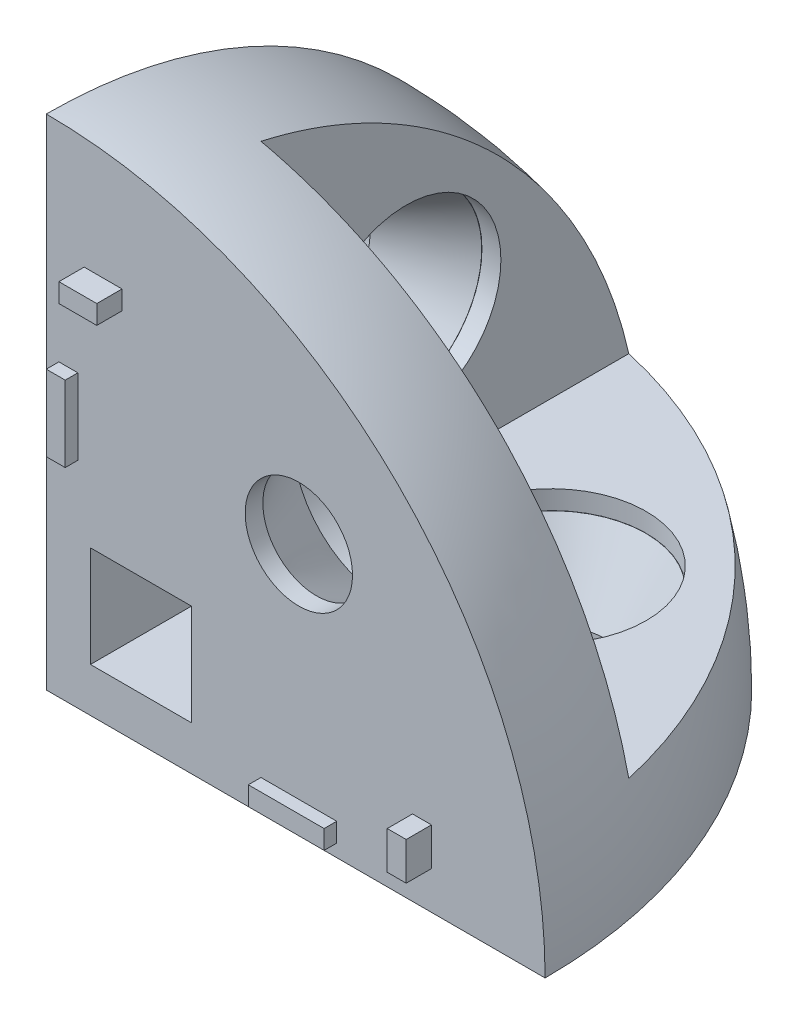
ISO-10303-21;
HEADER;
FILE_DESCRIPTION(('STEP AP214'),'2;1');
FILE_NAME('part.step','',(''),(''),'','','');
FILE_SCHEMA(('AUTOMOTIVE_DESIGN { 1 0 10303 214 1 1 1 1 }'));
ENDSEC;
DATA;
#1=APPLICATION_CONTEXT('core data for automotive mechanical design processes');
#2=APPLICATION_PROTOCOL_DEFINITION('international standard','automotive_design',2000,#1);
#3=PRODUCT_CONTEXT('',#1,'mechanical');
#4=PRODUCT('Part','Part','',(#3));
#5=PRODUCT_RELATED_PRODUCT_CATEGORY('part','',(#4));
#6=PRODUCT_DEFINITION_FORMATION('','',#4);
#7=PRODUCT_DEFINITION_CONTEXT('part definition',#1,'design');
#8=PRODUCT_DEFINITION('design','',#6,#7);
#9=PRODUCT_DEFINITION_SHAPE('','',#8);
#10=(LENGTH_UNIT() NAMED_UNIT(*) SI_UNIT(.MILLI.,.METRE.));
#11=(NAMED_UNIT(*) PLANE_ANGLE_UNIT() SI_UNIT($,.RADIAN.));
#12=(NAMED_UNIT(*) SI_UNIT($,.STERADIAN.) SOLID_ANGLE_UNIT());
#13=UNCERTAINTY_MEASURE_WITH_UNIT(LENGTH_MEASURE(1.E-05),#10,'distance_accuracy_value','');
#14=(GEOMETRIC_REPRESENTATION_CONTEXT(3) GLOBAL_UNCERTAINTY_ASSIGNED_CONTEXT((#13)) GLOBAL_UNIT_ASSIGNED_CONTEXT((#10,
#11,#12)) REPRESENTATION_CONTEXT('',''));
#15=CARTESIAN_POINT('',(0.,0.,0.));
#16=DIRECTION('',(0.,0.,1.));
#17=DIRECTION('',(1.,0.,0.));
#18=AXIS2_PLACEMENT_3D('',#15,#16,#17);
#19=CARTESIAN_POINT('',(0.,0.,0.));
#20=DIRECTION('',(0.,0.,1.));
#21=DIRECTION('',(1.,0.,0.));
#22=AXIS2_PLACEMENT_3D('',#19,#20,#21);
#23=PLANE('',#22);
#24=DIRECTION('',(1.,0.,0.));
#25=VECTOR('',#24,1.);
#26=CARTESIAN_POINT('',(3.,29.,0.));
#27=LINE('',#26,#25);
#28=CARTESIAN_POINT('',(3.,29.,0.));
#29=VERTEX_POINT('',#28);
#30=CARTESIAN_POINT('',(6.,29.,0.));
#31=VERTEX_POINT('',#30);
#32=EDGE_CURVE('E702',#29,#31,#27,.T.);
#33=ORIENTED_EDGE('',*,*,#32,.F.);
#34=DIRECTION('',(0.,-1.,0.));
#35=VECTOR('',#34,1.);
#36=CARTESIAN_POINT('',(3.,30.5,0.));
#37=LINE('',#36,#35);
#38=CARTESIAN_POINT('',(3.,30.5,0.));
#39=VERTEX_POINT('',#38);
#40=EDGE_CURVE('E688',#39,#29,#37,.T.);
#41=ORIENTED_EDGE('',*,*,#40,.F.);
#42=DIRECTION('',(-1.,0.,0.));
#43=VECTOR('',#42,1.);
#44=CARTESIAN_POINT('',(3.,30.5,0.));
#45=LINE('',#44,#43);
#46=CARTESIAN_POINT('',(6.,30.5,0.));
#47=VERTEX_POINT('',#46);
#48=EDGE_CURVE('E693',#47,#39,#45,.T.);
#49=ORIENTED_EDGE('',*,*,#48,.F.);
#50=DIRECTION('',(0.,1.,0.));
#51=VECTOR('',#50,1.);
#52=CARTESIAN_POINT('',(6.,30.5,0.));
#53=LINE('',#52,#51);
#54=EDGE_CURVE('E704',#31,#47,#53,.T.);
#55=ORIENTED_EDGE('',*,*,#54,.F.);
#56=EDGE_LOOP('',(#33,#41,#49,#55));
#57=FACE_BOUND('',#56,.T.);
#58=DIRECTION('',(1.,0.,0.));
#59=VECTOR('',#58,1.);
#60=CARTESIAN_POINT('',(0.999999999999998,17.,0.));
#61=LINE('',#60,#59);
#62=CARTESIAN_POINT('',(0.999999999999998,17.,0.));
#63=VERTEX_POINT('',#62);
#64=CARTESIAN_POINT('',(2.49999999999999,17.,0.));
#65=VERTEX_POINT('',#64);
#66=EDGE_CURVE('E760',#63,#65,#61,.T.);
#67=ORIENTED_EDGE('',*,*,#66,.F.);
#68=DIRECTION('',(0.,-1.,0.));
#69=VECTOR('',#68,1.);
#70=CARTESIAN_POINT('',(0.999999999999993,23.,0.));
#71=LINE('',#70,#69);
#72=CARTESIAN_POINT('',(0.999999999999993,23.,0.));
#73=VERTEX_POINT('',#72);
#74=EDGE_CURVE('E746',#73,#63,#71,.T.);
#75=ORIENTED_EDGE('',*,*,#74,.F.);
#76=DIRECTION('',(-1.,0.,0.));
#77=VECTOR('',#76,1.);
#78=CARTESIAN_POINT('',(0.999999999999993,23.,0.));
#79=LINE('',#78,#77);
#80=CARTESIAN_POINT('',(2.49999999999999,23.,0.));
#81=VERTEX_POINT('',#80);
#82=EDGE_CURVE('E751',#81,#73,#79,.T.);
#83=ORIENTED_EDGE('',*,*,#82,.F.);
#84=DIRECTION('',(0.,1.,0.));
#85=VECTOR('',#84,1.);
#86=CARTESIAN_POINT('',(2.49999999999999,23.,0.));
#87=LINE('',#86,#85);
#88=EDGE_CURVE('E762',#65,#81,#87,.T.);
#89=ORIENTED_EDGE('',*,*,#88,.F.);
#90=EDGE_LOOP('',(#67,#75,#83,#89));
#91=FACE_BOUND('',#90,.T.);
#92=DIRECTION('',(0.,-1.,0.));
#93=VECTOR('',#92,1.);
#94=CARTESIAN_POINT('',(3.5,11.5,0.));
#95=LINE('',#94,#93);
#96=CARTESIAN_POINT('',(3.5,11.5,0.));
#97=VERTEX_POINT('',#96);
#98=CARTESIAN_POINT('',(3.5,3.5,0.));
#99=VERTEX_POINT('',#98);
#100=EDGE_CURVE('E775',#97,#99,#95,.T.);
#101=ORIENTED_EDGE('',*,*,#100,.F.);
#102=DIRECTION('',(-1.,0.,0.));
#103=VECTOR('',#102,1.);
#104=CARTESIAN_POINT('',(3.5,11.5,0.));
#105=LINE('',#104,#103);
#106=CARTESIAN_POINT('',(11.5,11.5,0.));
#107=VERTEX_POINT('',#106);
#108=EDGE_CURVE('E780',#107,#97,#105,.T.);
#109=ORIENTED_EDGE('',*,*,#108,.F.);
#110=DIRECTION('',(0.,1.,0.));
#111=VECTOR('',#110,1.);
#112=CARTESIAN_POINT('',(11.5,11.5,0.));
#113=LINE('',#112,#111);
#114=CARTESIAN_POINT('',(11.5,3.5,0.));
#115=VERTEX_POINT('',#114);
#116=EDGE_CURVE('E793',#115,#107,#113,.T.);
#117=ORIENTED_EDGE('',*,*,#116,.F.);
#118=DIRECTION('',(1.,0.,0.));
#119=VECTOR('',#118,1.);
#120=CARTESIAN_POINT('',(3.5,3.5,0.));
#121=LINE('',#120,#119);
#122=EDGE_CURVE('E790',#99,#115,#121,.T.);
#123=ORIENTED_EDGE('',*,*,#122,.F.);
#124=EDGE_LOOP('',(#101,#109,#117,#123));
#125=FACE_BOUND('',#124,.T.);
#126=CARTESIAN_POINT('',(20.,20.,0.));
#127=DIRECTION('',(0.,0.,1.));
#128=DIRECTION('',(1.,0.,0.));
#129=AXIS2_PLACEMENT_3D('',#126,#127,#128);
#130=CIRCLE('',#129,4.25);
#131=CARTESIAN_POINT('',(24.25,20.,0.));
#132=VERTEX_POINT('',#131);
#133=EDGE_CURVE('E842',#132,#132,#130,.T.);
#134=ORIENTED_EDGE('',*,*,#133,.F.);
#135=EDGE_LOOP('',(#134));
#136=FACE_BOUND('',#135,.T.);
#137=DIRECTION('',(1.,0.,0.));
#138=VECTOR('',#137,1.);
#139=CARTESIAN_POINT('',(0.,0.,0.));
#140=LINE('',#139,#138);
#141=CARTESIAN_POINT('',(0.,0.,0.));
#142=VERTEX_POINT('',#141);
#143=CARTESIAN_POINT('',(39.5,0.,0.));
#144=VERTEX_POINT('',#143);
#145=EDGE_CURVE('E855',#142,#144,#140,.T.);
#146=ORIENTED_EDGE('',*,*,#145,.T.);
#147=CARTESIAN_POINT('',(0.,0.,0.));
#148=DIRECTION('',(0.,0.,1.));
#149=DIRECTION('',(1.,0.,0.));
#150=AXIS2_PLACEMENT_3D('',#147,#148,#149);
#151=CIRCLE('',#150,39.5);
#152=CARTESIAN_POINT('',(0.,39.5,0.));
#153=VERTEX_POINT('',#152);
#154=EDGE_CURVE('E858',#144,#153,#151,.T.);
#155=ORIENTED_EDGE('',*,*,#154,.T.);
#156=DIRECTION('',(0.,-1.,0.));
#157=VECTOR('',#156,1.);
#158=CARTESIAN_POINT('',(0.,0.,0.));
#159=LINE('',#158,#157);
#160=EDGE_CURVE('E867',#153,#142,#159,.T.);
#161=ORIENTED_EDGE('',*,*,#160,.T.);
#162=EDGE_LOOP('',(#146,#155,#161));
#163=FACE_BOUND('',#162,.T.);
#164=DIRECTION('',(1.,0.,0.));
#165=VECTOR('',#164,1.);
#166=CARTESIAN_POINT('',(17.,1.,0.));
#167=LINE('',#166,#165);
#168=CARTESIAN_POINT('',(17.,1.,0.));
#169=VERTEX_POINT('',#168);
#170=CARTESIAN_POINT('',(23.,1.,0.));
#171=VERTEX_POINT('',#170);
#172=EDGE_CURVE('E731',#169,#171,#167,.T.);
#173=ORIENTED_EDGE('',*,*,#172,.F.);
#174=DIRECTION('',(0.,-1.,0.));
#175=VECTOR('',#174,1.);
#176=CARTESIAN_POINT('',(17.,1.,0.));
#177=LINE('',#176,#175);
#178=CARTESIAN_POINT('',(17.,2.5,0.));
#179=VERTEX_POINT('',#178);
#180=EDGE_CURVE('E717',#179,#169,#177,.T.);
#181=ORIENTED_EDGE('',*,*,#180,.F.);
#182=DIRECTION('',(-1.,0.,0.));
#183=VECTOR('',#182,1.);
#184=CARTESIAN_POINT('',(17.,2.5,0.));
#185=LINE('',#184,#183);
#186=CARTESIAN_POINT('',(23.,2.5,0.));
#187=VERTEX_POINT('',#186);
#188=EDGE_CURVE('E722',#187,#179,#185,.T.);
#189=ORIENTED_EDGE('',*,*,#188,.F.);
#190=DIRECTION('',(0.,1.,0.));
#191=VECTOR('',#190,1.);
#192=CARTESIAN_POINT('',(23.,1.,0.));
#193=LINE('',#192,#191);
#194=EDGE_CURVE('E733',#171,#187,#193,.T.);
#195=ORIENTED_EDGE('',*,*,#194,.F.);
#196=EDGE_LOOP('',(#173,#181,#189,#195));
#197=FACE_BOUND('',#196,.T.);
#198=DIRECTION('',(1.,0.,0.));
#199=VECTOR('',#198,1.);
#200=CARTESIAN_POINT('',(29.,3.,0.));
#201=LINE('',#200,#199);
#202=CARTESIAN_POINT('',(29.,3.,0.));
#203=VERTEX_POINT('',#202);
#204=CARTESIAN_POINT('',(30.5,3.,0.));
#205=VERTEX_POINT('',#204);
#206=EDGE_CURVE('E673',#203,#205,#201,.T.);
#207=ORIENTED_EDGE('',*,*,#206,.F.);
#208=DIRECTION('',(0.,-1.,0.));
#209=VECTOR('',#208,1.);
#210=CARTESIAN_POINT('',(29.,3.,0.));
#211=LINE('',#210,#209);
#212=CARTESIAN_POINT('',(29.,6.,0.));
#213=VERTEX_POINT('',#212);
#214=EDGE_CURVE('E659',#213,#203,#211,.T.);
#215=ORIENTED_EDGE('',*,*,#214,.F.);
#216=DIRECTION('',(-1.,0.,0.));
#217=VECTOR('',#216,1.);
#218=CARTESIAN_POINT('',(29.,6.,0.));
#219=LINE('',#218,#217);
#220=CARTESIAN_POINT('',(30.5,6.,0.));
#221=VERTEX_POINT('',#220);
#222=EDGE_CURVE('E664',#221,#213,#219,.T.);
#223=ORIENTED_EDGE('',*,*,#222,.F.);
#224=DIRECTION('',(0.,1.,0.));
#225=VECTOR('',#224,1.);
#226=CARTESIAN_POINT('',(30.5,3.,0.));
#227=LINE('',#226,#225);
#228=EDGE_CURVE('E675',#205,#221,#227,.T.);
#229=ORIENTED_EDGE('',*,*,#228,.F.);
#230=EDGE_LOOP('',(#207,#215,#223,#229));
#231=FACE_BOUND('',#230,.T.);
#232=ADVANCED_FACE('F31',(#57,#91,#125,#136,#163,#197,#231),#23,.T.);
#233=CARTESIAN_POINT('',(0.,0.,0.));
#234=DIRECTION('',(0.,-1.,0.));
#235=DIRECTION('',(0.,0.,-1.));
#236=AXIS2_PLACEMENT_3D('',#233,#234,#235);
#237=PLANE('',#236);
#238=DIRECTION('',(0.,0.,1.));
#239=VECTOR('',#238,1.);
#240=CARTESIAN_POINT('',(29.,0.,-3.));
#241=LINE('',#240,#239);
#242=CARTESIAN_POINT('',(29.,0.,-6.));
#243=VERTEX_POINT('',#242);
#244=CARTESIAN_POINT('',(29.,0.,-3.));
#245=VERTEX_POINT('',#244);
#246=EDGE_CURVE('E531',#243,#245,#241,.T.);
#247=ORIENTED_EDGE('',*,*,#246,.T.);
#248=DIRECTION('',(1.,0.,0.));
#249=VECTOR('',#248,1.);
#250=CARTESIAN_POINT('',(29.,0.,-3.));
#251=LINE('',#250,#249);
#252=CARTESIAN_POINT('',(30.5,0.,-3.));
#253=VERTEX_POINT('',#252);
#254=EDGE_CURVE('E536',#245,#253,#251,.T.);
#255=ORIENTED_EDGE('',*,*,#254,.T.);
#256=DIRECTION('',(0.,0.,-1.));
#257=VECTOR('',#256,1.);
#258=CARTESIAN_POINT('',(30.5,0.,-3.));
#259=LINE('',#258,#257);
#260=CARTESIAN_POINT('',(30.5,0.,-6.));
#261=VERTEX_POINT('',#260);
#262=EDGE_CURVE('E549',#253,#261,#259,.T.);
#263=ORIENTED_EDGE('',*,*,#262,.T.);
#264=DIRECTION('',(-1.,0.,0.));
#265=VECTOR('',#264,1.);
#266=CARTESIAN_POINT('',(29.,0.,-6.));
#267=LINE('',#266,#265);
#268=EDGE_CURVE('E547',#261,#243,#267,.T.);
#269=ORIENTED_EDGE('',*,*,#268,.T.);
#270=EDGE_LOOP('',(#247,#255,#263,#269));
#271=FACE_BOUND('',#270,.T.);
#272=DIRECTION('',(0.,0.,1.));
#273=VECTOR('',#272,1.);
#274=CARTESIAN_POINT('',(3.,0.,-30.5));
#275=LINE('',#274,#273);
#276=CARTESIAN_POINT('',(3.,0.,-30.5));
#277=VERTEX_POINT('',#276);
#278=CARTESIAN_POINT('',(3.,0.,-29.));
#279=VERTEX_POINT('',#278);
#280=EDGE_CURVE('E563',#277,#279,#275,.T.);
#281=ORIENTED_EDGE('',*,*,#280,.T.);
#282=DIRECTION('',(1.,0.,0.));
#283=VECTOR('',#282,1.);
#284=CARTESIAN_POINT('',(3.,0.,-29.));
#285=LINE('',#284,#283);
#286=CARTESIAN_POINT('',(6.,0.,-29.));
#287=VERTEX_POINT('',#286);
#288=EDGE_CURVE('E568',#279,#287,#285,.T.);
#289=ORIENTED_EDGE('',*,*,#288,.T.);
#290=DIRECTION('',(0.,0.,-1.));
#291=VECTOR('',#290,1.);
#292=CARTESIAN_POINT('',(6.,0.,-30.5));
#293=LINE('',#292,#291);
#294=CARTESIAN_POINT('',(6.,0.,-30.5));
#295=VERTEX_POINT('',#294);
#296=EDGE_CURVE('E581',#287,#295,#293,.T.);
#297=ORIENTED_EDGE('',*,*,#296,.T.);
#298=DIRECTION('',(-1.,0.,0.));
#299=VECTOR('',#298,1.);
#300=CARTESIAN_POINT('',(3.,0.,-30.5));
#301=LINE('',#300,#299);
#302=EDGE_CURVE('E579',#295,#277,#301,.T.);
#303=ORIENTED_EDGE('',*,*,#302,.T.);
#304=EDGE_LOOP('',(#281,#289,#297,#303));
#305=FACE_BOUND('',#304,.T.);
#306=DIRECTION('',(0.,0.,1.));
#307=VECTOR('',#306,1.);
#308=CARTESIAN_POINT('',(17.,0.,-0.999999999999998));
#309=LINE('',#308,#307);
#310=CARTESIAN_POINT('',(17.,0.,-2.5));
#311=VERTEX_POINT('',#310);
#312=CARTESIAN_POINT('',(17.,0.,-0.999999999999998));
#313=VERTEX_POINT('',#312);
#314=EDGE_CURVE('E595',#311,#313,#309,.T.);
#315=ORIENTED_EDGE('',*,*,#314,.T.);
#316=DIRECTION('',(1.,0.,0.));
#317=VECTOR('',#316,1.);
#318=CARTESIAN_POINT('',(17.,0.,-0.999999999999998));
#319=LINE('',#318,#317);
#320=CARTESIAN_POINT('',(23.,0.,-0.999999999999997));
#321=VERTEX_POINT('',#320);
#322=EDGE_CURVE('E600',#313,#321,#319,.T.);
#323=ORIENTED_EDGE('',*,*,#322,.T.);
#324=DIRECTION('',(0.,0.,-1.));
#325=VECTOR('',#324,1.);
#326=CARTESIAN_POINT('',(23.,0.,-0.999999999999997));
#327=LINE('',#326,#325);
#328=CARTESIAN_POINT('',(23.,0.,-2.5));
#329=VERTEX_POINT('',#328);
#330=EDGE_CURVE('E613',#321,#329,#327,.T.);
#331=ORIENTED_EDGE('',*,*,#330,.T.);
#332=DIRECTION('',(-1.,0.,0.));
#333=VECTOR('',#332,1.);
#334=CARTESIAN_POINT('',(17.,0.,-2.5));
#335=LINE('',#334,#333);
#336=EDGE_CURVE('E611',#329,#311,#335,.T.);
#337=ORIENTED_EDGE('',*,*,#336,.T.);
#338=EDGE_LOOP('',(#315,#323,#331,#337));
#339=FACE_BOUND('',#338,.T.);
#340=DIRECTION('',(0.,0.,1.));
#341=VECTOR('',#340,1.);
#342=CARTESIAN_POINT('',(0.999999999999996,0.,-23.));
#343=LINE('',#342,#341);
#344=CARTESIAN_POINT('',(0.999999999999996,0.,-23.));
#345=VERTEX_POINT('',#344);
#346=CARTESIAN_POINT('',(1.,0.,-17.));
#347=VERTEX_POINT('',#346);
#348=EDGE_CURVE('E627',#345,#347,#343,.T.);
#349=ORIENTED_EDGE('',*,*,#348,.T.);
#350=DIRECTION('',(1.,0.,0.));
#351=VECTOR('',#350,1.);
#352=CARTESIAN_POINT('',(1.,0.,-17.));
#353=LINE('',#352,#351);
#354=CARTESIAN_POINT('',(2.5,0.,-17.));
#355=VERTEX_POINT('',#354);
#356=EDGE_CURVE('E632',#347,#355,#353,.T.);
#357=ORIENTED_EDGE('',*,*,#356,.T.);
#358=DIRECTION('',(0.,0.,-1.));
#359=VECTOR('',#358,1.);
#360=CARTESIAN_POINT('',(2.5,0.,-23.));
#361=LINE('',#360,#359);
#362=CARTESIAN_POINT('',(2.5,0.,-23.));
#363=VERTEX_POINT('',#362);
#364=EDGE_CURVE('E645',#355,#363,#361,.T.);
#365=ORIENTED_EDGE('',*,*,#364,.T.);
#366=DIRECTION('',(-1.,0.,0.));
#367=VECTOR('',#366,1.);
#368=CARTESIAN_POINT('',(0.999999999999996,0.,-23.));
#369=LINE('',#368,#367);
#370=EDGE_CURVE('E643',#363,#345,#369,.T.);
#371=ORIENTED_EDGE('',*,*,#370,.T.);
#372=EDGE_LOOP('',(#349,#357,#365,#371));
#373=FACE_BOUND('',#372,.T.);
#374=CARTESIAN_POINT('',(0.,0.,0.));
#375=DIRECTION('',(0.,-1.,0.));
#376=DIRECTION('',(0.,0.,-1.));
#377=AXIS2_PLACEMENT_3D('',#374,#375,#376);
#378=CIRCLE('',#377,39.5);
#379=CARTESIAN_POINT('',(-1.37913512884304E-13,0.,-39.5));
#380=VERTEX_POINT('',#379);
#381=EDGE_CURVE('E870',#380,#144,#378,.T.);
#382=ORIENTED_EDGE('',*,*,#381,.T.);
#383=ORIENTED_EDGE('',*,*,#145,.F.);
#384=DIRECTION('',(0.,0.,-1.));
#385=VECTOR('',#384,1.);
#386=CARTESIAN_POINT('',(0.,0.,0.));
#387=LINE('',#386,#385);
#388=EDGE_CURVE('E861',#142,#380,#387,.T.);
#389=ORIENTED_EDGE('',*,*,#388,.T.);
#390=EDGE_LOOP('',(#382,#383,#389));
#391=FACE_BOUND('',#390,.T.);
#392=CARTESIAN_POINT('',(20.,0.,-20.));
#393=DIRECTION('',(0.,1.,0.));
#394=DIRECTION('',(1.,0.,0.));
#395=AXIS2_PLACEMENT_3D('',#392,#393,#394);
#396=CIRCLE('',#395,4.25);
#397=CARTESIAN_POINT('',(20.,0.,-24.25));
#398=VERTEX_POINT('',#397);
#399=EDGE_CURVE('E824',#398,#398,#396,.T.);
#400=ORIENTED_EDGE('',*,*,#399,.T.);
#401=EDGE_LOOP('',(#400));
#402=FACE_BOUND('',#401,.T.);
#403=ADVANCED_FACE('F955',(#271,#305,#339,#373,#391,#402),#237,.T.);
#404=CARTESIAN_POINT('',(8.5,8.5,-39.5));
#405=DIRECTION('',(0.,-1.,0.));
#406=DIRECTION('',(0.,0.,-1.));
#407=AXIS2_PLACEMENT_3D('',#404,#405,#406);
#408=PLANE('',#407);
#409=CARTESIAN_POINT('',(20.,8.49999999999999,-20.));
#410=DIRECTION('',(0.,1.,0.));
#411=DIRECTION('',(1.,0.,0.));
#412=AXIS2_PLACEMENT_3D('',#409,#410,#411);
#413=CIRCLE('',#412,7.5);
#414=CARTESIAN_POINT('',(27.5,8.5,-20.));
#415=VERTEX_POINT('',#414);
#416=EDGE_CURVE('E820',#415,#415,#413,.T.);
#417=ORIENTED_EDGE('',*,*,#416,.F.);
#418=EDGE_LOOP('',(#417));
#419=FACE_BOUND('',#418,.T.);
#420=DIRECTION('',(-1.,0.,0.));
#421=VECTOR('',#420,1.);
#422=CARTESIAN_POINT('',(8.5,8.5,-11.5));
#423=LINE('',#422,#421);
#424=CARTESIAN_POINT('',(11.5,8.5,-11.5));
#425=VERTEX_POINT('',#424);
#426=CARTESIAN_POINT('',(8.5,8.5,-11.5));
#427=VERTEX_POINT('',#426);
#428=EDGE_CURVE('E818',#425,#427,#423,.T.);
#429=ORIENTED_EDGE('',*,*,#428,.F.);
#430=DIRECTION('',(0.,0.,1.));
#431=VECTOR('',#430,1.);
#432=CARTESIAN_POINT('',(11.5,8.5,-39.5));
#433=LINE('',#432,#431);
#434=CARTESIAN_POINT('',(11.5,8.5,-8.5));
#435=VERTEX_POINT('',#434);
#436=EDGE_CURVE('E809',#425,#435,#433,.T.);
#437=ORIENTED_EDGE('',*,*,#436,.T.);
#438=DIRECTION('',(1.,0.,0.));
#439=VECTOR('',#438,1.);
#440=CARTESIAN_POINT('',(8.5,8.5,-8.5));
#441=LINE('',#440,#439);
#442=CARTESIAN_POINT('',(37.6264534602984,8.5,-8.5));
#443=VERTEX_POINT('',#442);
#444=EDGE_CURVE('E850',#435,#443,#441,.T.);
#445=ORIENTED_EDGE('',*,*,#444,.T.);
#446=CARTESIAN_POINT('',(0.,8.5,0.));
#447=DIRECTION('',(0.,-1.,0.));
#448=DIRECTION('',(0.,0.,-1.));
#449=AXIS2_PLACEMENT_3D('',#446,#447,#448);
#450=CIRCLE('',#449,38.5746030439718);
#451=CARTESIAN_POINT('',(8.5,8.5,-37.6264534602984));
#452=VERTEX_POINT('',#451);
#453=EDGE_CURVE('E878',#443,#452,#450,.F.);
#454=ORIENTED_EDGE('',*,*,#453,.T.);
#455=DIRECTION('',(0.,0.,1.));
#456=VECTOR('',#455,1.);
#457=CARTESIAN_POINT('',(8.5,8.5,-39.5));
#458=LINE('',#457,#456);
#459=EDGE_CURVE('E852',#452,#427,#458,.T.);
#460=ORIENTED_EDGE('',*,*,#459,.T.);
#461=EDGE_LOOP('',(#429,#437,#445,#454,#460));
#462=FACE_BOUND('',#461,.T.);
#463=ADVANCED_FACE('F942',(#419,#462),#408,.F.);
#464=CARTESIAN_POINT('',(0.,0.,0.));
#465=DIRECTION('',(1.,0.,0.));
#466=DIRECTION('',(0.,0.,-1.));
#467=AXIS2_PLACEMENT_3D('',#464,#465,#466);
#468=PLANE('',#467);
#469=DIRECTION('',(0.,0.,1.));
#470=VECTOR('',#469,1.);
#471=CARTESIAN_POINT('',(0.,6.00000000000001,-29.));
#472=LINE('',#471,#470);
#473=CARTESIAN_POINT('',(0.,6.00000000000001,-30.5));
#474=VERTEX_POINT('',#473);
#475=CARTESIAN_POINT('',(0.,6.00000000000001,-29.));
#476=VERTEX_POINT('',#475);
#477=EDGE_CURVE('E427',#474,#476,#472,.T.);
#478=ORIENTED_EDGE('',*,*,#477,.T.);
#479=DIRECTION('',(0.,-1.,0.));
#480=VECTOR('',#479,1.);
#481=CARTESIAN_POINT('',(0.,3.00000000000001,-29.));
#482=LINE('',#481,#480);
#483=CARTESIAN_POINT('',(0.,3.00000000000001,-29.));
#484=VERTEX_POINT('',#483);
#485=EDGE_CURVE('E401',#476,#484,#482,.T.);
#486=ORIENTED_EDGE('',*,*,#485,.T.);
#487=DIRECTION('',(0.,0.,-1.));
#488=VECTOR('',#487,1.);
#489=CARTESIAN_POINT('',(0.,3.00000000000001,-29.));
#490=LINE('',#489,#488);
#491=CARTESIAN_POINT('',(-1.06490180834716E-13,3.00000000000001,-30.5));
#492=VERTEX_POINT('',#491);
#493=EDGE_CURVE('E417',#484,#492,#490,.T.);
#494=ORIENTED_EDGE('',*,*,#493,.T.);
#495=DIRECTION('',(0.,1.,0.));
#496=VECTOR('',#495,1.);
#497=CARTESIAN_POINT('',(0.,3.00000000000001,-30.5));
#498=LINE('',#497,#496);
#499=EDGE_CURVE('E46',#492,#474,#498,.T.);
#500=ORIENTED_EDGE('',*,*,#499,.T.);
#501=EDGE_LOOP('',(#478,#486,#494,#500));
#502=FACE_BOUND('',#501,.T.);
#503=DIRECTION('',(0.,0.,1.));
#504=VECTOR('',#503,1.);
#505=CARTESIAN_POINT('',(0.,30.5,-3.));
#506=LINE('',#505,#504);
#507=CARTESIAN_POINT('',(0.,30.5,-6.));
#508=VERTEX_POINT('',#507);
#509=CARTESIAN_POINT('',(0.,30.5,-3.));
#510=VERTEX_POINT('',#509);
#511=EDGE_CURVE('E452',#508,#510,#506,.T.);
#512=ORIENTED_EDGE('',*,*,#511,.T.);
#513=DIRECTION('',(0.,-1.,0.));
#514=VECTOR('',#513,1.);
#515=CARTESIAN_POINT('',(0.,30.5,-3.));
#516=LINE('',#515,#514);
#517=CARTESIAN_POINT('',(0.,29.,-3.));
#518=VERTEX_POINT('',#517);
#519=EDGE_CURVE('E406',#510,#518,#516,.T.);
#520=ORIENTED_EDGE('',*,*,#519,.T.);
#521=DIRECTION('',(0.,0.,-1.));
#522=VECTOR('',#521,1.);
#523=CARTESIAN_POINT('',(0.,29.,-3.));
#524=LINE('',#523,#522);
#525=CARTESIAN_POINT('',(0.,29.,-6.));
#526=VERTEX_POINT('',#525);
#527=EDGE_CURVE('E440',#518,#526,#524,.T.);
#528=ORIENTED_EDGE('',*,*,#527,.T.);
#529=DIRECTION('',(0.,1.,0.));
#530=VECTOR('',#529,1.);
#531=CARTESIAN_POINT('',(0.,30.5,-6.));
#532=LINE('',#531,#530);
#533=EDGE_CURVE('E54',#526,#508,#532,.T.);
#534=ORIENTED_EDGE('',*,*,#533,.T.);
#535=EDGE_LOOP('',(#512,#520,#528,#534));
#536=FACE_BOUND('',#535,.T.);
#537=DIRECTION('',(0.,0.,1.));
#538=VECTOR('',#537,1.);
#539=CARTESIAN_POINT('',(0.,2.5,-17.));
#540=LINE('',#539,#538);
#541=CARTESIAN_POINT('',(0.,2.5,-23.));
#542=VERTEX_POINT('',#541);
#543=CARTESIAN_POINT('',(0.,2.5,-17.));
#544=VERTEX_POINT('',#543);
#545=EDGE_CURVE('E482',#542,#544,#540,.T.);
#546=ORIENTED_EDGE('',*,*,#545,.T.);
#547=DIRECTION('',(0.,-1.,0.));
#548=VECTOR('',#547,1.);
#549=CARTESIAN_POINT('',(0.,1.,-17.));
#550=LINE('',#549,#548);
#551=CARTESIAN_POINT('',(0.,1.,-17.));
#552=VERTEX_POINT('',#551);
#553=EDGE_CURVE('E465',#544,#552,#550,.T.);
#554=ORIENTED_EDGE('',*,*,#553,.T.);
#555=DIRECTION('',(0.,0.,-1.));
#556=VECTOR('',#555,1.);
#557=CARTESIAN_POINT('',(0.,1.,-17.));
#558=LINE('',#557,#556);
#559=CARTESIAN_POINT('',(0.,1.,-23.));
#560=VERTEX_POINT('',#559);
#561=EDGE_CURVE('E470',#552,#560,#558,.T.);
#562=ORIENTED_EDGE('',*,*,#561,.T.);
#563=DIRECTION('',(0.,1.,0.));
#564=VECTOR('',#563,1.);
#565=CARTESIAN_POINT('',(0.,1.,-23.));
#566=LINE('',#565,#564);
#567=EDGE_CURVE('E485',#560,#542,#566,.T.);
#568=ORIENTED_EDGE('',*,*,#567,.T.);
#569=EDGE_LOOP('',(#546,#554,#562,#568));
#570=FACE_BOUND('',#569,.T.);
#571=DIRECTION('',(0.,0.,1.));
#572=VECTOR('',#571,1.);
#573=CARTESIAN_POINT('',(0.,23.,-0.99999999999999));
#574=LINE('',#573,#572);
#575=CARTESIAN_POINT('',(0.,23.,-2.49999999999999));
#576=VERTEX_POINT('',#575);
#577=CARTESIAN_POINT('',(0.,23.,-0.99999999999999));
#578=VERTEX_POINT('',#577);
#579=EDGE_CURVE('E515',#576,#578,#574,.T.);
#580=ORIENTED_EDGE('',*,*,#579,.T.);
#581=DIRECTION('',(0.,-1.,0.));
#582=VECTOR('',#581,1.);
#583=CARTESIAN_POINT('',(0.,23.,-0.99999999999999));
#584=LINE('',#583,#582);
#585=CARTESIAN_POINT('',(0.,17.,-0.999999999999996));
#586=VERTEX_POINT('',#585);
#587=EDGE_CURVE('E498',#578,#586,#584,.T.);
#588=ORIENTED_EDGE('',*,*,#587,.T.);
#589=DIRECTION('',(0.,0.,-1.));
#590=VECTOR('',#589,1.);
#591=CARTESIAN_POINT('',(0.,17.,-0.999999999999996));
#592=LINE('',#591,#590);
#593=CARTESIAN_POINT('',(0.,17.,-2.49999999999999));
#594=VERTEX_POINT('',#593);
#595=EDGE_CURVE('E503',#586,#594,#592,.T.);
#596=ORIENTED_EDGE('',*,*,#595,.T.);
#597=DIRECTION('',(0.,1.,0.));
#598=VECTOR('',#597,1.);
#599=CARTESIAN_POINT('',(0.,23.,-2.49999999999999));
#600=LINE('',#599,#598);
#601=EDGE_CURVE('E518',#594,#576,#600,.T.);
#602=ORIENTED_EDGE('',*,*,#601,.T.);
#603=EDGE_LOOP('',(#580,#588,#596,#602));
#604=FACE_BOUND('',#603,.T.);
#605=ORIENTED_EDGE('',*,*,#388,.F.);
#606=ORIENTED_EDGE('',*,*,#160,.F.);
#607=CARTESIAN_POINT('',(0.,0.,0.));
#608=DIRECTION('',(1.,0.,0.));
#609=DIRECTION('',(0.,0.,-1.));
#610=AXIS2_PLACEMENT_3D('',#607,#608,#609);
#611=CIRCLE('',#610,39.5);
#612=EDGE_CURVE('E864',#380,#153,#611,.T.);
#613=ORIENTED_EDGE('',*,*,#612,.F.);
#614=EDGE_LOOP('',(#605,#606,#613));
#615=FACE_BOUND('',#614,.T.);
#616=CARTESIAN_POINT('',(0.,20.,-20.));
#617=DIRECTION('',(1.,0.,0.));
#618=DIRECTION('',(0.,0.,-1.));
#619=AXIS2_PLACEMENT_3D('',#616,#617,#618);
#620=CIRCLE('',#619,4.25);
#621=CARTESIAN_POINT('',(0.,20.,-24.25));
#622=VERTEX_POINT('',#621);
#623=EDGE_CURVE('E833',#622,#622,#620,.T.);
#624=ORIENTED_EDGE('',*,*,#623,.T.);
#625=EDGE_LOOP('',(#624));
#626=FACE_BOUND('',#625,.T.);
#627=ADVANCED_FACE('F923',(#502,#536,#570,#604,#615,#626),#468,.F.);
#628=CARTESIAN_POINT('',(8.5,38.6513950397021,-39.5));
#629=DIRECTION('',(-1.,0.,0.));
#630=DIRECTION('',(0.,-1.,0.));
#631=AXIS2_PLACEMENT_3D('',#628,#629,#630);
#632=PLANE('',#631);
#633=CARTESIAN_POINT('',(8.49999999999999,20.,-20.));
#634=DIRECTION('',(1.,0.,0.));
#635=DIRECTION('',(0.,0.,-1.));
#636=AXIS2_PLACEMENT_3D('',#633,#634,#635);
#637=CIRCLE('',#636,7.5);
#638=CARTESIAN_POINT('',(8.49999999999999,20.,-27.5));
#639=VERTEX_POINT('',#638);
#640=EDGE_CURVE('E829',#639,#639,#637,.T.);
#641=ORIENTED_EDGE('',*,*,#640,.F.);
#642=EDGE_LOOP('',(#641));
#643=FACE_BOUND('',#642,.T.);
#644=DIRECTION('',(0.,-1.,0.));
#645=VECTOR('',#644,1.);
#646=CARTESIAN_POINT('',(8.5,38.6513950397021,-8.5));
#647=LINE('',#646,#645);
#648=CARTESIAN_POINT('',(8.5,37.6264534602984,-8.5));
#649=VERTEX_POINT('',#648);
#650=CARTESIAN_POINT('',(8.5,11.5,-8.5));
#651=VERTEX_POINT('',#650);
#652=EDGE_CURVE('E847',#649,#651,#647,.T.);
#653=ORIENTED_EDGE('',*,*,#652,.T.);
#654=DIRECTION('',(0.,0.,-1.));
#655=VECTOR('',#654,1.);
#656=CARTESIAN_POINT('',(8.5,11.5,-39.5));
#657=LINE('',#656,#655);
#658=CARTESIAN_POINT('',(8.5,11.5,-11.5));
#659=VERTEX_POINT('',#658);
#660=EDGE_CURVE('E815',#651,#659,#657,.T.);
#661=ORIENTED_EDGE('',*,*,#660,.T.);
#662=DIRECTION('',(0.,1.,0.));
#663=VECTOR('',#662,1.);
#664=CARTESIAN_POINT('',(8.5,38.6513950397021,-11.5));
#665=LINE('',#664,#663);
#666=EDGE_CURVE('E11',#427,#659,#665,.T.);
#667=ORIENTED_EDGE('',*,*,#666,.F.);
#668=ORIENTED_EDGE('',*,*,#459,.F.);
#669=CARTESIAN_POINT('',(8.50000000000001,0.,0.));
#670=DIRECTION('',(-1.,0.,0.));
#671=DIRECTION('',(0.,-1.,0.));
#672=AXIS2_PLACEMENT_3D('',#669,#670,#671);
#673=CIRCLE('',#672,38.5746030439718);
#674=EDGE_CURVE('E875',#452,#649,#673,.F.);
#675=ORIENTED_EDGE('',*,*,#674,.T.);
#676=EDGE_LOOP('',(#653,#661,#667,#668,#675));
#677=FACE_BOUND('',#676,.T.);
#678=ADVANCED_FACE('F919',(#643,#677),#632,.F.);
#679=CARTESIAN_POINT('',(36.6492761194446,40.725998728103,-8.5));
#680=DIRECTION('',(0.,0.,1.));
#681=DIRECTION('',(1.,0.,0.));
#682=AXIS2_PLACEMENT_3D('',#679,#680,#681);
#683=PLANE('',#682);
#684=DIRECTION('',(0.,1.,0.));
#685=VECTOR('',#684,1.);
#686=CARTESIAN_POINT('',(11.5,40.725998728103,-8.5));
#687=LINE('',#686,#685);
#688=CARTESIAN_POINT('',(11.5,11.5,-8.5));
#689=VERTEX_POINT('',#688);
#690=EDGE_CURVE('E800',#435,#689,#687,.T.);
#691=ORIENTED_EDGE('',*,*,#690,.T.);
#692=DIRECTION('',(-1.,0.,0.));
#693=VECTOR('',#692,1.);
#694=CARTESIAN_POINT('',(36.6492761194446,11.5,-8.5));
#695=LINE('',#694,#693);
#696=EDGE_CURVE('E812',#689,#651,#695,.T.);
#697=ORIENTED_EDGE('',*,*,#696,.T.);
#698=ORIENTED_EDGE('',*,*,#652,.F.);
#699=CARTESIAN_POINT('',(0.,0.,-8.5));
#700=DIRECTION('',(0.,0.,1.));
#701=DIRECTION('',(1.,0.,0.));
#702=AXIS2_PLACEMENT_3D('',#699,#700,#701);
#703=CIRCLE('',#702,38.5746030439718);
#704=EDGE_CURVE('E872',#649,#443,#703,.F.);
#705=ORIENTED_EDGE('',*,*,#704,.T.);
#706=ORIENTED_EDGE('',*,*,#444,.F.);
#707=EDGE_LOOP('',(#691,#697,#698,#705,#706));
#708=FACE_BOUND('',#707,.T.);
#709=CARTESIAN_POINT('',(20.,20.,-8.5));
#710=DIRECTION('',(0.,0.,1.));
#711=DIRECTION('',(1.,0.,0.));
#712=AXIS2_PLACEMENT_3D('',#709,#710,#711);
#713=CIRCLE('',#712,7.5);
#714=CARTESIAN_POINT('',(27.5,20.,-8.5));
#715=VERTEX_POINT('',#714);
#716=EDGE_CURVE('E838',#715,#715,#713,.T.);
#717=ORIENTED_EDGE('',*,*,#716,.T.);
#718=EDGE_LOOP('',(#717));
#719=FACE_BOUND('',#718,.T.);
#720=ADVANCED_FACE('F922',(#708,#719),#683,.F.);
#721=CARTESIAN_POINT('',(0.,0.,0.));
#722=DIRECTION('',(0.,-1.,0.));
#723=DIRECTION('',(0.,0.,-1.));
#724=AXIS2_PLACEMENT_3D('',#721,#722,#723);
#725=SPHERICAL_SURFACE('',#724,39.5);
#726=ORIENTED_EDGE('',*,*,#453,.F.);
#727=ORIENTED_EDGE('',*,*,#704,.F.);
#728=ORIENTED_EDGE('',*,*,#674,.F.);
#729=EDGE_LOOP('',(#726,#727,#728));
#730=FACE_BOUND('',#729,.T.);
#731=ORIENTED_EDGE('',*,*,#154,.F.);
#732=ORIENTED_EDGE('',*,*,#381,.F.);
#733=ORIENTED_EDGE('',*,*,#612,.T.);
#734=EDGE_LOOP('',(#731,#732,#733));
#735=FACE_BOUND('',#734,.T.);
#736=ADVANCED_FACE('F944',(#730,#735),#725,.T.);
#737=CARTESIAN_POINT('',(20.,20.,-39.5));
#738=DIRECTION('',(0.,0.,1.));
#739=DIRECTION('',(1.,0.,0.));
#740=AXIS2_PLACEMENT_3D('',#737,#738,#739);
#741=CYLINDRICAL_SURFACE('',#740,4.25);
#742=CARTESIAN_POINT('',(20.,20.,-1.39999999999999));
#743=DIRECTION('',(0.,0.,1.));
#744=DIRECTION('',(1.,0.,0.));
#745=AXIS2_PLACEMENT_3D('',#742,#743,#744);
#746=CIRCLE('',#745,4.25);
#747=CARTESIAN_POINT('',(24.25,20.,-1.39999999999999));
#748=VERTEX_POINT('',#747);
#749=EDGE_CURVE('E880',#748,#748,#746,.F.);
#750=ORIENTED_EDGE('',*,*,#749,.T.);
#751=EDGE_LOOP('',(#750));
#752=FACE_BOUND('',#751,.T.);
#753=ORIENTED_EDGE('',*,*,#133,.T.);
#754=EDGE_LOOP('',(#753));
#755=FACE_BOUND('',#754,.T.);
#756=ADVANCED_FACE('F947',(#752,#755),#741,.F.);
#757=CARTESIAN_POINT('',(20.,20.,-7.));
#758=DIRECTION('',(0.,0.,1.));
#759=DIRECTION('',(1.,0.,0.));
#760=AXIS2_PLACEMENT_3D('',#757,#758,#759);
#761=PLANE('',#760);
#762=CARTESIAN_POINT('',(20.,20.,-7.));
#763=DIRECTION('',(0.,0.,1.));
#764=DIRECTION('',(1.,0.,0.));
#765=AXIS2_PLACEMENT_3D('',#762,#763,#764);
#766=CIRCLE('',#765,7.48316150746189);
#767=CARTESIAN_POINT('',(27.4831615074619,20.,-7.));
#768=VERTEX_POINT('',#767);
#769=EDGE_CURVE('E883',#768,#768,#766,.T.);
#770=ORIENTED_EDGE('',*,*,#769,.T.);
#771=EDGE_LOOP('',(#770));
#772=FACE_BOUND('',#771,.T.);
#773=CARTESIAN_POINT('',(20.,20.,-7.));
#774=DIRECTION('',(0.,0.,1.));
#775=DIRECTION('',(1.,0.,0.));
#776=AXIS2_PLACEMENT_3D('',#773,#774,#775);
#777=CIRCLE('',#776,7.5);
#778=CARTESIAN_POINT('',(27.5,20.,-7.));
#779=VERTEX_POINT('',#778);
#780=EDGE_CURVE('E839',#779,#779,#777,.T.);
#781=ORIENTED_EDGE('',*,*,#780,.F.);
#782=EDGE_LOOP('',(#781));
#783=FACE_BOUND('',#782,.T.);
#784=ADVANCED_FACE('F969',(#772,#783),#761,.F.);
#785=CARTESIAN_POINT('',(20.,20.,-7.));
#786=DIRECTION('',(0.,0.,-1.));
#787=DIRECTION('',(-1.,0.,0.));
#788=AXIS2_PLACEMENT_3D('',#785,#786,#787);
#789=CYLINDRICAL_SURFACE('',#788,7.5);
#790=ORIENTED_EDGE('',*,*,#780,.T.);
#791=EDGE_LOOP('',(#790));
#792=FACE_BOUND('',#791,.T.);
#793=ORIENTED_EDGE('',*,*,#716,.F.);
#794=EDGE_LOOP('',(#793));
#795=FACE_BOUND('',#794,.T.);
#796=ADVANCED_FACE('F964',(#792,#795),#789,.F.);
#797=CARTESIAN_POINT('',(39.5,20.,-20.));
#798=DIRECTION('',(-1.,0.,0.));
#799=DIRECTION('',(0.,0.,1.));
#800=AXIS2_PLACEMENT_3D('',#797,#798,#799);
#801=CYLINDRICAL_SURFACE('',#800,4.25);
#802=CARTESIAN_POINT('',(1.39999999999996,20.,-20.));
#803=DIRECTION('',(-1.,0.,0.));
#804=DIRECTION('',(0.,0.,1.));
#805=AXIS2_PLACEMENT_3D('',#802,#803,#804);
#806=CIRCLE('',#805,4.25);
#807=CARTESIAN_POINT('',(1.39999999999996,20.,-15.75));
#808=VERTEX_POINT('',#807);
#809=EDGE_CURVE('E39',#808,#808,#806,.F.);
#810=ORIENTED_EDGE('',*,*,#809,.T.);
#811=EDGE_LOOP('',(#810));
#812=FACE_BOUND('',#811,.T.);
#813=ORIENTED_EDGE('',*,*,#623,.F.);
#814=EDGE_LOOP('',(#813));
#815=FACE_BOUND('',#814,.T.);
#816=ADVANCED_FACE('F897',(#812,#815),#801,.F.);
#817=CARTESIAN_POINT('',(7.,20.,-20.));
#818=DIRECTION('',(1.,0.,0.));
#819=DIRECTION('',(0.,0.,-1.));
#820=AXIS2_PLACEMENT_3D('',#817,#818,#819);
#821=CYLINDRICAL_SURFACE('',#820,7.5);
#822=CARTESIAN_POINT('',(7.,20.,-20.));
#823=DIRECTION('',(1.,0.,0.));
#824=DIRECTION('',(0.,0.,-1.));
#825=AXIS2_PLACEMENT_3D('',#822,#823,#824);
#826=CIRCLE('',#825,7.5);
#827=CARTESIAN_POINT('',(6.99999999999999,20.,-27.5));
#828=VERTEX_POINT('',#827);
#829=EDGE_CURVE('E830',#828,#828,#826,.T.);
#830=ORIENTED_EDGE('',*,*,#829,.F.);
#831=EDGE_LOOP('',(#830));
#832=FACE_BOUND('',#831,.T.);
#833=ORIENTED_EDGE('',*,*,#640,.T.);
#834=EDGE_LOOP('',(#833));
#835=FACE_BOUND('',#834,.T.);
#836=ADVANCED_FACE('F910',(#832,#835),#821,.F.);
#837=CARTESIAN_POINT('',(7.,20.,-20.));
#838=DIRECTION('',(-1.,0.,0.));
#839=DIRECTION('',(0.,0.,-1.));
#840=AXIS2_PLACEMENT_3D('',#837,#838,#839);
#841=PLANE('',#840);
#842=CARTESIAN_POINT('',(7.,20.,-20.));
#843=DIRECTION('',(-1.,0.,0.));
#844=DIRECTION('',(0.,0.,1.));
#845=AXIS2_PLACEMENT_3D('',#842,#843,#844);
#846=CIRCLE('',#845,7.4831615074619);
#847=CARTESIAN_POINT('',(7.,20.,-12.5168384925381));
#848=VERTEX_POINT('',#847);
#849=EDGE_CURVE('E892',#848,#848,#846,.T.);
#850=ORIENTED_EDGE('',*,*,#849,.T.);
#851=EDGE_LOOP('',(#850));
#852=FACE_BOUND('',#851,.T.);
#853=ORIENTED_EDGE('',*,*,#829,.T.);
#854=EDGE_LOOP('',(#853));
#855=FACE_BOUND('',#854,.T.);
#856=ADVANCED_FACE('F906',(#852,#855),#841,.F.);
#857=CARTESIAN_POINT('',(20.,39.5,-20.));
#858=DIRECTION('',(0.,-1.,0.));
#859=DIRECTION('',(0.,0.,-1.));
#860=AXIS2_PLACEMENT_3D('',#857,#858,#859);
#861=CYLINDRICAL_SURFACE('',#860,4.25);
#862=CARTESIAN_POINT('',(20.,1.40000000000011,-20.));
#863=DIRECTION('',(0.,-1.,0.));
#864=DIRECTION('',(0.,0.,-1.));
#865=AXIS2_PLACEMENT_3D('',#862,#863,#864);
#866=CIRCLE('',#865,4.25);
#867=CARTESIAN_POINT('',(20.,1.40000000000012,-24.25));
#868=VERTEX_POINT('',#867);
#869=EDGE_CURVE('E889',#868,#868,#866,.F.);
#870=CARTESIAN_POINT('',(20.,1.40000000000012,-24.25));
#871=CARTESIAN_POINT('',(20.,1.38541666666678,-24.25));
#872=CARTESIAN_POINT('',(20.,1.37083333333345,-24.25));
#873=CARTESIAN_POINT('',(20.,1.34166666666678,-24.25));
#874=CARTESIAN_POINT('',(20.,1.32708333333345,-24.25));
#875=CARTESIAN_POINT('',(20.,1.29791666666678,-24.25));
#876=CARTESIAN_POINT('',(20.,1.28333333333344,-24.25));
#877=CARTESIAN_POINT('',(20.,1.25416666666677,-24.25));
#878=CARTESIAN_POINT('',(20.,1.23958333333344,-24.25));
#879=CARTESIAN_POINT('',(20.,1.21041666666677,-24.25));
#880=CARTESIAN_POINT('',(20.,1.19583333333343,-24.25));
#881=CARTESIAN_POINT('',(20.,1.16666666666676,-24.25));
#882=CARTESIAN_POINT('',(20.,1.15208333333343,-24.25));
#883=CARTESIAN_POINT('',(20.,1.12291666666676,-24.25));
#884=CARTESIAN_POINT('',(20.,1.10833333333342,-24.25));
#885=CARTESIAN_POINT('',(20.,1.07916666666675,-24.25));
#886=CARTESIAN_POINT('',(20.,1.06458333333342,-24.25));
#887=CARTESIAN_POINT('',(20.,1.03541666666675,-24.25));
#888=CARTESIAN_POINT('',(20.,1.02083333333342,-24.25));
#889=CARTESIAN_POINT('',(20.,0.991666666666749,-24.25));
#890=CARTESIAN_POINT('',(20.,0.977083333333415,-24.25));
#891=CARTESIAN_POINT('',(20.,0.947916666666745,-24.25));
#892=CARTESIAN_POINT('',(20.,0.933333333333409,-24.25));
#893=CARTESIAN_POINT('',(20.,0.904166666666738,-24.25));
#894=CARTESIAN_POINT('',(20.,0.889583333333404,-24.25));
#895=CARTESIAN_POINT('',(20.,0.860416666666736,-24.25));
#896=CARTESIAN_POINT('',(20.,0.845833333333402,-24.25));
#897=CARTESIAN_POINT('',(20.,0.816666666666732,-24.25));
#898=CARTESIAN_POINT('',(20.,0.802083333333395,-24.25));
#899=CARTESIAN_POINT('',(20.,0.772916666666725,-24.25));
#900=CARTESIAN_POINT('',(20.,0.758333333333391,-24.25));
#901=CARTESIAN_POINT('',(20.,0.729166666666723,-24.25));
#902=CARTESIAN_POINT('',(20.,0.714583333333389,-24.25));
#903=CARTESIAN_POINT('',(20.,0.685416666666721,-24.25));
#904=CARTESIAN_POINT('',(20.,0.670833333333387,-24.25));
#905=CARTESIAN_POINT('',(20.,0.641666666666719,-24.25));
#906=CARTESIAN_POINT('',(20.,0.627083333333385,-24.25));
#907=CARTESIAN_POINT('',(20.,0.597916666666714,-24.25));
#908=CARTESIAN_POINT('',(20.,0.583333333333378,-24.25));
#909=CARTESIAN_POINT('',(20.,0.554166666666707,-24.25));
#910=CARTESIAN_POINT('',(20.,0.539583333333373,-24.25));
#911=CARTESIAN_POINT('',(20.,0.510416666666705,-24.25));
#912=CARTESIAN_POINT('',(20.,0.495833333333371,-24.25));
#913=CARTESIAN_POINT('',(20.,0.466666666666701,-24.25));
#914=CARTESIAN_POINT('',(20.,0.452083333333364,-24.25));
#915=CARTESIAN_POINT('',(20.,0.422916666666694,-24.25));
#916=CARTESIAN_POINT('',(20.,0.40833333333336,-24.25));
#917=CARTESIAN_POINT('',(20.,0.379166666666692,-24.25));
#918=CARTESIAN_POINT('',(20.,0.364583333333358,-24.25));
#919=CARTESIAN_POINT('',(20.,0.33541666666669,-24.25));
#920=CARTESIAN_POINT('',(20.,0.320833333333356,-24.25));
#921=CARTESIAN_POINT('',(20.,0.291666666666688,-24.25));
#922=CARTESIAN_POINT('',(20.,0.277083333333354,-24.25));
#923=CARTESIAN_POINT('',(20.,0.247916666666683,-24.25));
#924=CARTESIAN_POINT('',(20.,0.233333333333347,-24.25));
#925=CARTESIAN_POINT('',(20.,0.204166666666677,-24.25));
#926=CARTESIAN_POINT('',(20.,0.189583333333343,-24.25));
#927=CARTESIAN_POINT('',(20.,0.160416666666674,-24.25));
#928=CARTESIAN_POINT('',(20.,0.14583333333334,-24.25));
#929=CARTESIAN_POINT('',(20.,0.11666666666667,-24.25));
#930=CARTESIAN_POINT('',(20.,0.102083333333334,-24.25));
#931=CARTESIAN_POINT('',(20.,0.0729166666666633,-24.25));
#932=CARTESIAN_POINT('',(20.,0.0583333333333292,-24.25));
#933=CARTESIAN_POINT('',(20.,0.0291666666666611,-24.25));
#934=CARTESIAN_POINT('',(20.,0.0145833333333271,-24.25));
#935=CARTESIAN_POINT('',(20.,0.,-24.25));
#936=B_SPLINE_CURVE_WITH_KNOTS('',3,(#870,#871,#872,#873,#874,#875,#876,#877,#878,#879,#880,
#881,#882,#883,#884,#885,#886,#887,#888,#889,#890,#891,#892,#893,#894,#895,#896,#897,#898,#899,
#900,#901,#902,#903,#904,#905,#906,#907,#908,#909,#910,#911,#912,#913,#914,#915,#916,#917,#918,
#919,#920,#921,#922,#923,#924,#925,#926,#927,#928,#929,#930,#931,#932,#933,#934,#935),
.UNSPECIFIED.,.F.,.F.,(4,2,2,2,2,2,2,2,2,2,2,2,2,2,2,2,2,2,2,2,2,2,2,2,2,2,2,2,2,2,2,2,4),(0.,
0.0437500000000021,0.0875000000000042,0.131250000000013,0.175000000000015,0.218750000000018,
0.262500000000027,0.306250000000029,0.350000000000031,0.393750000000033,0.437500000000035,
0.481250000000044,0.525000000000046,0.568750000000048,0.612500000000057,0.65625000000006,
0.700000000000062,0.743750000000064,0.787500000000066,0.831250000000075,0.875000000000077,
0.918750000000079,0.962500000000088,1.00625000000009,1.05000000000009,1.09375000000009,
1.1375000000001,1.18125000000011,1.22500000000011,1.26875000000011,1.31250000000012,
1.35625000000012,1.40000000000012),.UNSPECIFIED.);
#937=EDGE_CURVE('BSEAM909',#868,#398,#936,.T.);
#938=ORIENTED_EDGE('',*,*,#869,.T.);
#939=ORIENTED_EDGE('',*,*,#399,.F.);
#940=ORIENTED_EDGE('',*,*,#937,.T.);
#941=ORIENTED_EDGE('',*,*,#937,.F.);
#942=EDGE_LOOP('',(#938,#940,#939,#941));
#943=FACE_BOUND('',#942,.T.);
#944=ADVANCED_FACE('F909',(#943),#861,.F.);
#945=CARTESIAN_POINT('',(20.,7.,-20.));
#946=DIRECTION('',(0.,1.,0.));
#947=DIRECTION('',(0.,0.,1.));
#948=AXIS2_PLACEMENT_3D('',#945,#946,#947);
#949=CYLINDRICAL_SURFACE('',#948,7.5);
#950=CARTESIAN_POINT('',(20.,7.,-20.));
#951=DIRECTION('',(0.,1.,0.));
#952=DIRECTION('',(1.,0.,0.));
#953=AXIS2_PLACEMENT_3D('',#950,#951,#952);
#954=CIRCLE('',#953,7.5);
#955=CARTESIAN_POINT('',(27.5,7.,-20.));
#956=VERTEX_POINT('',#955);
#957=EDGE_CURVE('E821',#956,#956,#954,.T.);
#958=ORIENTED_EDGE('',*,*,#957,.F.);
#959=EDGE_LOOP('',(#958));
#960=FACE_BOUND('',#959,.T.);
#961=ORIENTED_EDGE('',*,*,#416,.T.);
#962=EDGE_LOOP('',(#961));
#963=FACE_BOUND('',#962,.T.);
#964=ADVANCED_FACE('F999',(#960,#963),#949,.F.);
#965=CARTESIAN_POINT('',(20.,7.,-20.));
#966=DIRECTION('',(0.,-1.,0.));
#967=DIRECTION('',(1.,0.,0.));
#968=AXIS2_PLACEMENT_3D('',#965,#966,#967);
#969=PLANE('',#968);
#970=CARTESIAN_POINT('',(20.,7.,-20.));
#971=DIRECTION('',(0.,-1.,0.));
#972=DIRECTION('',(0.,0.,-1.));
#973=AXIS2_PLACEMENT_3D('',#970,#971,#972);
#974=CIRCLE('',#973,7.48316150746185);
#975=CARTESIAN_POINT('',(20.,6.99999999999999,-27.4831615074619));
#976=VERTEX_POINT('',#975);
#977=EDGE_CURVE('E886',#976,#976,#974,.T.);
#978=ORIENTED_EDGE('',*,*,#977,.T.);
#979=EDGE_LOOP('',(#978));
#980=FACE_BOUND('',#979,.T.);
#981=ORIENTED_EDGE('',*,*,#957,.T.);
#982=EDGE_LOOP('',(#981));
#983=FACE_BOUND('',#982,.T.);
#984=ADVANCED_FACE('F987',(#980,#983),#969,.F.);
#985=CARTESIAN_POINT('',(20.,20.,-1.39999999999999));
#986=DIRECTION('',(0.,0.,-1.));
#987=DIRECTION('',(-1.,0.,0.));
#988=AXIS2_PLACEMENT_3D('',#985,#986,#987);
#989=CONICAL_SURFACE('',#988,4.25,0.523598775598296);
#990=ORIENTED_EDGE('',*,*,#769,.F.);
#991=EDGE_LOOP('',(#990));
#992=FACE_BOUND('',#991,.T.);
#993=ORIENTED_EDGE('',*,*,#749,.F.);
#994=EDGE_LOOP('',(#993));
#995=FACE_BOUND('',#994,.T.);
#996=ADVANCED_FACE('F985',(#992,#995),#989,.F.);
#997=CARTESIAN_POINT('',(20.,6.99999999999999,-20.));
#998=DIRECTION('',(0.,1.,0.));
#999=DIRECTION('',(0.,0.,1.));
#1000=AXIS2_PLACEMENT_3D('',#997,#998,#999);
#1001=CONICAL_SURFACE('',#1000,7.48316150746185,0.523598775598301);
#1002=ORIENTED_EDGE('',*,*,#869,.F.);
#1003=EDGE_LOOP('',(#1002));
#1004=FACE_BOUND('',#1003,.T.);
#1005=ORIENTED_EDGE('',*,*,#977,.F.);
#1006=EDGE_LOOP('',(#1005));
#1007=FACE_BOUND('',#1006,.T.);
#1008=ADVANCED_FACE('F903',(#1004,#1007),#1001,.F.);
#1009=CARTESIAN_POINT('',(7.,20.,-20.));
#1010=DIRECTION('',(1.,0.,0.));
#1011=DIRECTION('',(0.,0.,-1.));
#1012=AXIS2_PLACEMENT_3D('',#1009,#1010,#1011);
#1013=CONICAL_SURFACE('',#1012,7.4831615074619,0.523598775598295);
#1014=ORIENTED_EDGE('',*,*,#809,.F.);
#1015=EDGE_LOOP('',(#1014));
#1016=FACE_BOUND('',#1015,.T.);
#1017=ORIENTED_EDGE('',*,*,#849,.F.);
#1018=EDGE_LOOP('',(#1017));
#1019=FACE_BOUND('',#1018,.T.);
#1020=ADVANCED_FACE('F33',(#1016,#1019),#1013,.F.);
#1021=CARTESIAN_POINT('',(3.5,3.5,-11.5));
#1022=DIRECTION('',(0.,0.,1.));
#1023=DIRECTION('',(1.,0.,0.));
#1024=AXIS2_PLACEMENT_3D('',#1021,#1022,#1023);
#1025=PLANE('',#1024);
#1026=ORIENTED_EDGE('',*,*,#428,.T.);
#1027=ORIENTED_EDGE('',*,*,#666,.T.);
#1028=DIRECTION('',(-1.,0.,0.));
#1029=VECTOR('',#1028,1.);
#1030=CARTESIAN_POINT('',(3.5,11.5,-11.5));
#1031=LINE('',#1030,#1029);
#1032=CARTESIAN_POINT('',(3.5,11.5,-11.5));
#1033=VERTEX_POINT('',#1032);
#1034=EDGE_CURVE('E786',#659,#1033,#1031,.T.);
#1035=ORIENTED_EDGE('',*,*,#1034,.T.);
#1036=DIRECTION('',(0.,-1.,0.));
#1037=VECTOR('',#1036,1.);
#1038=CARTESIAN_POINT('',(3.5,11.5,-11.5));
#1039=LINE('',#1038,#1037);
#1040=CARTESIAN_POINT('',(3.5,3.5,-11.5));
#1041=VERTEX_POINT('',#1040);
#1042=EDGE_CURVE('E776',#1033,#1041,#1039,.T.);
#1043=ORIENTED_EDGE('',*,*,#1042,.T.);
#1044=DIRECTION('',(1.,0.,0.));
#1045=VECTOR('',#1044,1.);
#1046=CARTESIAN_POINT('',(3.5,3.5,-11.5));
#1047=LINE('',#1046,#1045);
#1048=CARTESIAN_POINT('',(11.5,3.5,-11.5));
#1049=VERTEX_POINT('',#1048);
#1050=EDGE_CURVE('E779',#1041,#1049,#1047,.T.);
#1051=ORIENTED_EDGE('',*,*,#1050,.T.);
#1052=DIRECTION('',(0.,1.,0.));
#1053=VECTOR('',#1052,1.);
#1054=CARTESIAN_POINT('',(11.5,11.5,-11.5));
#1055=LINE('',#1054,#1053);
#1056=EDGE_CURVE('E783',#1049,#425,#1055,.T.);
#1057=ORIENTED_EDGE('',*,*,#1056,.T.);
#1058=EDGE_LOOP('',(#1026,#1027,#1035,#1043,#1051,#1057));
#1059=FACE_BOUND('',#1058,.T.);
#1060=ADVANCED_FACE('F902',(#1059),#1025,.T.);
#1061=CARTESIAN_POINT('',(3.5,11.5,-11.5));
#1062=DIRECTION('',(0.,1.,0.));
#1063=DIRECTION('',(-1.,0.,0.));
#1064=AXIS2_PLACEMENT_3D('',#1061,#1062,#1063);
#1065=PLANE('',#1064);
#1066=ORIENTED_EDGE('',*,*,#696,.F.);
#1067=DIRECTION('',(0.,0.,1.));
#1068=VECTOR('',#1067,1.);
#1069=CARTESIAN_POINT('',(11.5,11.5,-11.5));
#1070=LINE('',#1069,#1068);
#1071=EDGE_CURVE('E801',#689,#107,#1070,.T.);
#1072=ORIENTED_EDGE('',*,*,#1071,.T.);
#1073=ORIENTED_EDGE('',*,*,#108,.T.);
#1074=DIRECTION('',(0.,0.,1.));
#1075=VECTOR('',#1074,1.);
#1076=CARTESIAN_POINT('',(3.5,11.5,-11.5));
#1077=LINE('',#1076,#1075);
#1078=EDGE_CURVE('E798',#1033,#97,#1077,.T.);
#1079=ORIENTED_EDGE('',*,*,#1078,.F.);
#1080=ORIENTED_EDGE('',*,*,#1034,.F.);
#1081=ORIENTED_EDGE('',*,*,#660,.F.);
#1082=EDGE_LOOP('',(#1066,#1072,#1073,#1079,#1080,#1081));
#1083=FACE_BOUND('',#1082,.T.);
#1084=ADVANCED_FACE('F935',(#1083),#1065,.F.);
#1085=CARTESIAN_POINT('',(11.5,11.5,-11.5));
#1086=DIRECTION('',(1.,0.,0.));
#1087=DIRECTION('',(0.,1.,0.));
#1088=AXIS2_PLACEMENT_3D('',#1085,#1086,#1087);
#1089=PLANE('',#1088);
#1090=ORIENTED_EDGE('',*,*,#1056,.F.);
#1091=DIRECTION('',(0.,0.,1.));
#1092=VECTOR('',#1091,1.);
#1093=CARTESIAN_POINT('',(11.5,3.5,-11.5));
#1094=LINE('',#1093,#1092);
#1095=EDGE_CURVE('E803',#1049,#115,#1094,.T.);
#1096=ORIENTED_EDGE('',*,*,#1095,.T.);
#1097=ORIENTED_EDGE('',*,*,#116,.T.);
#1098=ORIENTED_EDGE('',*,*,#1071,.F.);
#1099=ORIENTED_EDGE('',*,*,#690,.F.);
#1100=ORIENTED_EDGE('',*,*,#436,.F.);
#1101=EDGE_LOOP('',(#1090,#1096,#1097,#1098,#1099,#1100));
#1102=FACE_BOUND('',#1101,.T.);
#1103=ADVANCED_FACE('F1092',(#1102),#1089,.F.);
#1104=CARTESIAN_POINT('',(3.5,11.5,-11.5));
#1105=DIRECTION('',(-1.,0.,0.));
#1106=DIRECTION('',(0.,-1.,0.));
#1107=AXIS2_PLACEMENT_3D('',#1104,#1105,#1106);
#1108=PLANE('',#1107);
#1109=ORIENTED_EDGE('',*,*,#100,.T.);
#1110=DIRECTION('',(0.,0.,1.));
#1111=VECTOR('',#1110,1.);
#1112=CARTESIAN_POINT('',(3.5,3.5,-11.5));
#1113=LINE('',#1112,#1111);
#1114=EDGE_CURVE('E788',#1041,#99,#1113,.T.);
#1115=ORIENTED_EDGE('',*,*,#1114,.F.);
#1116=ORIENTED_EDGE('',*,*,#1042,.F.);
#1117=ORIENTED_EDGE('',*,*,#1078,.T.);
#1118=EDGE_LOOP('',(#1109,#1115,#1116,#1117));
#1119=FACE_BOUND('',#1118,.T.);
#1120=ADVANCED_FACE('F1101',(#1119),#1108,.F.);
#1121=CARTESIAN_POINT('',(3.5,3.5,-11.5));
#1122=DIRECTION('',(0.,-1.,0.));
#1123=DIRECTION('',(0.,0.,-1.));
#1124=AXIS2_PLACEMENT_3D('',#1121,#1122,#1123);
#1125=PLANE('',#1124);
#1126=ORIENTED_EDGE('',*,*,#122,.T.);
#1127=ORIENTED_EDGE('',*,*,#1095,.F.);
#1128=ORIENTED_EDGE('',*,*,#1050,.F.);
#1129=ORIENTED_EDGE('',*,*,#1114,.T.);
#1130=EDGE_LOOP('',(#1126,#1127,#1128,#1129));
#1131=FACE_BOUND('',#1130,.T.);
#1132=ADVANCED_FACE('F1111',(#1131),#1125,.F.);
#1133=CARTESIAN_POINT('',(0.999999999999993,23.,1.));
#1134=DIRECTION('',(1.,0.,0.));
#1135=DIRECTION('',(0.,1.,0.));
#1136=AXIS2_PLACEMENT_3D('',#1133,#1134,#1135);
#1137=PLANE('',#1136);
#1138=ORIENTED_EDGE('',*,*,#74,.T.);
#1139=DIRECTION('',(0.,0.,-1.));
#1140=VECTOR('',#1139,1.);
#1141=CARTESIAN_POINT('',(0.999999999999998,17.,1.));
#1142=LINE('',#1141,#1140);
#1143=CARTESIAN_POINT('',(0.999999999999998,17.,1.));
#1144=VERTEX_POINT('',#1143);
#1145=EDGE_CURVE('E773',#1144,#63,#1142,.T.);
#1146=ORIENTED_EDGE('',*,*,#1145,.F.);
#1147=DIRECTION('',(0.,-1.,0.));
#1148=VECTOR('',#1147,1.);
#1149=CARTESIAN_POINT('',(0.999999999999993,23.,1.));
#1150=LINE('',#1149,#1148);
#1151=CARTESIAN_POINT('',(0.999999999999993,23.,1.));
#1152=VERTEX_POINT('',#1151);
#1153=EDGE_CURVE('E747',#1152,#1144,#1150,.T.);
#1154=ORIENTED_EDGE('',*,*,#1153,.F.);
#1155=DIRECTION('',(0.,0.,-1.));
#1156=VECTOR('',#1155,1.);
#1157=CARTESIAN_POINT('',(0.999999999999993,23.,1.));
#1158=LINE('',#1157,#1156);
#1159=EDGE_CURVE('E757',#1152,#73,#1158,.T.);
#1160=ORIENTED_EDGE('',*,*,#1159,.T.);
#1161=EDGE_LOOP('',(#1138,#1146,#1154,#1160));
#1162=FACE_BOUND('',#1161,.T.);
#1163=ADVANCED_FACE('F1121',(#1162),#1137,.F.);
#1164=CARTESIAN_POINT('',(0.999999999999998,17.,1.));
#1165=DIRECTION('',(0.,1.,0.));
#1166=DIRECTION('',(0.,0.,1.));
#1167=AXIS2_PLACEMENT_3D('',#1164,#1165,#1166);
#1168=PLANE('',#1167);
#1169=ORIENTED_EDGE('',*,*,#66,.T.);
#1170=DIRECTION('',(0.,0.,-1.));
#1171=VECTOR('',#1170,1.);
#1172=CARTESIAN_POINT('',(2.49999999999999,17.,1.));
#1173=LINE('',#1172,#1171);
#1174=CARTESIAN_POINT('',(2.49999999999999,17.,1.));
#1175=VERTEX_POINT('',#1174);
#1176=EDGE_CURVE('E770',#1175,#65,#1173,.T.);
#1177=ORIENTED_EDGE('',*,*,#1176,.F.);
#1178=DIRECTION('',(1.,0.,0.));
#1179=VECTOR('',#1178,1.);
#1180=CARTESIAN_POINT('',(0.999999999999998,17.,1.));
#1181=LINE('',#1180,#1179);
#1182=EDGE_CURVE('E750',#1144,#1175,#1181,.T.);
#1183=ORIENTED_EDGE('',*,*,#1182,.F.);
#1184=ORIENTED_EDGE('',*,*,#1145,.T.);
#1185=EDGE_LOOP('',(#1169,#1177,#1183,#1184));
#1186=FACE_BOUND('',#1185,.T.);
#1187=ADVANCED_FACE('F1131',(#1186),#1168,.F.);
#1188=CARTESIAN_POINT('',(2.49999999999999,23.,1.));
#1189=DIRECTION('',(-1.,0.,0.));
#1190=DIRECTION('',(0.,0.,1.));
#1191=AXIS2_PLACEMENT_3D('',#1188,#1189,#1190);
#1192=PLANE('',#1191);
#1193=ORIENTED_EDGE('',*,*,#88,.T.);
#1194=DIRECTION('',(0.,0.,-1.));
#1195=VECTOR('',#1194,1.);
#1196=CARTESIAN_POINT('',(2.49999999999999,23.,1.));
#1197=LINE('',#1196,#1195);
#1198=CARTESIAN_POINT('',(2.49999999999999,23.,1.));
#1199=VERTEX_POINT('',#1198);
#1200=EDGE_CURVE('E768',#1199,#81,#1197,.T.);
#1201=ORIENTED_EDGE('',*,*,#1200,.F.);
#1202=DIRECTION('',(0.,1.,0.));
#1203=VECTOR('',#1202,1.);
#1204=CARTESIAN_POINT('',(2.49999999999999,23.,1.));
#1205=LINE('',#1204,#1203);
#1206=EDGE_CURVE('E753',#1175,#1199,#1205,.T.);
#1207=ORIENTED_EDGE('',*,*,#1206,.F.);
#1208=ORIENTED_EDGE('',*,*,#1176,.T.);
#1209=EDGE_LOOP('',(#1193,#1201,#1207,#1208));
#1210=FACE_BOUND('',#1209,.T.);
#1211=ADVANCED_FACE('F1141',(#1210),#1192,.F.);
#1212=CARTESIAN_POINT('',(0.999999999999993,23.,1.));
#1213=DIRECTION('',(0.,-1.,0.));
#1214=DIRECTION('',(0.,0.,-1.));
#1215=AXIS2_PLACEMENT_3D('',#1212,#1213,#1214);
#1216=PLANE('',#1215);
#1217=ORIENTED_EDGE('',*,*,#82,.T.);
#1218=ORIENTED_EDGE('',*,*,#1159,.F.);
#1219=DIRECTION('',(-1.,0.,0.));
#1220=VECTOR('',#1219,1.);
#1221=CARTESIAN_POINT('',(0.999999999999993,23.,1.));
#1222=LINE('',#1221,#1220);
#1223=EDGE_CURVE('E755',#1199,#1152,#1222,.T.);
#1224=ORIENTED_EDGE('',*,*,#1223,.F.);
#1225=ORIENTED_EDGE('',*,*,#1200,.T.);
#1226=EDGE_LOOP('',(#1217,#1218,#1224,#1225));
#1227=FACE_BOUND('',#1226,.T.);
#1228=ADVANCED_FACE('F1151',(#1227),#1216,.F.);
#1229=CARTESIAN_POINT('',(0.999999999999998,17.,1.));
#1230=DIRECTION('',(0.,0.,1.));
#1231=DIRECTION('',(1.,0.,0.));
#1232=AXIS2_PLACEMENT_3D('',#1229,#1230,#1231);
#1233=PLANE('',#1232);
#1234=ORIENTED_EDGE('',*,*,#1153,.T.);
#1235=ORIENTED_EDGE('',*,*,#1182,.T.);
#1236=ORIENTED_EDGE('',*,*,#1206,.T.);
#1237=ORIENTED_EDGE('',*,*,#1223,.T.);
#1238=EDGE_LOOP('',(#1234,#1235,#1236,#1237));
#1239=FACE_BOUND('',#1238,.T.);
#1240=ADVANCED_FACE('F1161',(#1239),#1233,.T.);
#1241=CARTESIAN_POINT('',(17.,1.,1.));
#1242=DIRECTION('',(1.,0.,0.));
#1243=DIRECTION('',(0.,0.,-1.));
#1244=AXIS2_PLACEMENT_3D('',#1241,#1242,#1243);
#1245=PLANE('',#1244);
#1246=ORIENTED_EDGE('',*,*,#180,.T.);
#1247=DIRECTION('',(0.,0.,-1.));
#1248=VECTOR('',#1247,1.);
#1249=CARTESIAN_POINT('',(17.,1.,1.));
#1250=LINE('',#1249,#1248);
#1251=CARTESIAN_POINT('',(17.,1.,1.));
#1252=VERTEX_POINT('',#1251);
#1253=EDGE_CURVE('E744',#1252,#169,#1250,.T.);
#1254=ORIENTED_EDGE('',*,*,#1253,.F.);
#1255=DIRECTION('',(0.,-1.,0.));
#1256=VECTOR('',#1255,1.);
#1257=CARTESIAN_POINT('',(17.,1.,1.));
#1258=LINE('',#1257,#1256);
#1259=CARTESIAN_POINT('',(17.,2.5,1.));
#1260=VERTEX_POINT('',#1259);
#1261=EDGE_CURVE('E718',#1260,#1252,#1258,.T.);
#1262=ORIENTED_EDGE('',*,*,#1261,.F.);
#1263=DIRECTION('',(0.,0.,-1.));
#1264=VECTOR('',#1263,1.);
#1265=CARTESIAN_POINT('',(17.,2.5,1.));
#1266=LINE('',#1265,#1264);
#1267=EDGE_CURVE('E728',#1260,#179,#1266,.T.);
#1268=ORIENTED_EDGE('',*,*,#1267,.T.);
#1269=EDGE_LOOP('',(#1246,#1254,#1262,#1268));
#1270=FACE_BOUND('',#1269,.T.);
#1271=ADVANCED_FACE('F1171',(#1270),#1245,.F.);
#1272=CARTESIAN_POINT('',(17.,1.,1.));
#1273=DIRECTION('',(0.,1.,0.));
#1274=DIRECTION('',(0.,0.,1.));
#1275=AXIS2_PLACEMENT_3D('',#1272,#1273,#1274);
#1276=PLANE('',#1275);
#1277=ORIENTED_EDGE('',*,*,#172,.T.);
#1278=DIRECTION('',(0.,0.,-1.));
#1279=VECTOR('',#1278,1.);
#1280=CARTESIAN_POINT('',(23.,1.,1.));
#1281=LINE('',#1280,#1279);
#1282=CARTESIAN_POINT('',(23.,1.,1.));
#1283=VERTEX_POINT('',#1282);
#1284=EDGE_CURVE('E741',#1283,#171,#1281,.T.);
#1285=ORIENTED_EDGE('',*,*,#1284,.F.);
#1286=DIRECTION('',(1.,0.,0.));
#1287=VECTOR('',#1286,1.);
#1288=CARTESIAN_POINT('',(17.,1.,1.));
#1289=LINE('',#1288,#1287);
#1290=EDGE_CURVE('E721',#1252,#1283,#1289,.T.);
#1291=ORIENTED_EDGE('',*,*,#1290,.F.);
#1292=ORIENTED_EDGE('',*,*,#1253,.T.);
#1293=EDGE_LOOP('',(#1277,#1285,#1291,#1292));
#1294=FACE_BOUND('',#1293,.T.);
#1295=ADVANCED_FACE('F1181',(#1294),#1276,.F.);
#1296=CARTESIAN_POINT('',(23.,1.,1.));
#1297=DIRECTION('',(-1.,0.,0.));
#1298=DIRECTION('',(0.,0.,1.));
#1299=AXIS2_PLACEMENT_3D('',#1296,#1297,#1298);
#1300=PLANE('',#1299);
#1301=ORIENTED_EDGE('',*,*,#194,.T.);
#1302=DIRECTION('',(0.,0.,-1.));
#1303=VECTOR('',#1302,1.);
#1304=CARTESIAN_POINT('',(23.,2.5,1.));
#1305=LINE('',#1304,#1303);
#1306=CARTESIAN_POINT('',(23.,2.5,1.));
#1307=VERTEX_POINT('',#1306);
#1308=EDGE_CURVE('E739',#1307,#187,#1305,.T.);
#1309=ORIENTED_EDGE('',*,*,#1308,.F.);
#1310=DIRECTION('',(0.,1.,0.));
#1311=VECTOR('',#1310,1.);
#1312=CARTESIAN_POINT('',(23.,1.,1.));
#1313=LINE('',#1312,#1311);
#1314=EDGE_CURVE('E724',#1283,#1307,#1313,.T.);
#1315=ORIENTED_EDGE('',*,*,#1314,.F.);
#1316=ORIENTED_EDGE('',*,*,#1284,.T.);
#1317=EDGE_LOOP('',(#1301,#1309,#1315,#1316));
#1318=FACE_BOUND('',#1317,.T.);
#1319=ADVANCED_FACE('F1191',(#1318),#1300,.F.);
#1320=CARTESIAN_POINT('',(17.,2.5,1.));
#1321=DIRECTION('',(0.,-1.,0.));
#1322=DIRECTION('',(0.,0.,-1.));
#1323=AXIS2_PLACEMENT_3D('',#1320,#1321,#1322);
#1324=PLANE('',#1323);
#1325=ORIENTED_EDGE('',*,*,#188,.T.);
#1326=ORIENTED_EDGE('',*,*,#1267,.F.);
#1327=DIRECTION('',(-1.,0.,0.));
#1328=VECTOR('',#1327,1.);
#1329=CARTESIAN_POINT('',(17.,2.5,1.));
#1330=LINE('',#1329,#1328);
#1331=EDGE_CURVE('E726',#1307,#1260,#1330,.T.);
#1332=ORIENTED_EDGE('',*,*,#1331,.F.);
#1333=ORIENTED_EDGE('',*,*,#1308,.T.);
#1334=EDGE_LOOP('',(#1325,#1326,#1332,#1333));
#1335=FACE_BOUND('',#1334,.T.);
#1336=ADVANCED_FACE('F1201',(#1335),#1324,.F.);
#1337=CARTESIAN_POINT('',(17.,2.5,1.));
#1338=DIRECTION('',(0.,0.,-1.));
#1339=DIRECTION('',(-1.,0.,0.));
#1340=AXIS2_PLACEMENT_3D('',#1337,#1338,#1339);
#1341=PLANE('',#1340);
#1342=ORIENTED_EDGE('',*,*,#1261,.T.);
#1343=ORIENTED_EDGE('',*,*,#1290,.T.);
#1344=ORIENTED_EDGE('',*,*,#1314,.T.);
#1345=ORIENTED_EDGE('',*,*,#1331,.T.);
#1346=EDGE_LOOP('',(#1342,#1343,#1344,#1345));
#1347=FACE_BOUND('',#1346,.T.);
#1348=ADVANCED_FACE('F1211',(#1347),#1341,.F.);
#1349=CARTESIAN_POINT('',(3.,30.5,2.));
#1350=DIRECTION('',(1.,0.,0.));
#1351=DIRECTION('',(0.,0.,-1.));
#1352=AXIS2_PLACEMENT_3D('',#1349,#1350,#1351);
#1353=PLANE('',#1352);
#1354=ORIENTED_EDGE('',*,*,#40,.T.);
#1355=DIRECTION('',(0.,0.,-1.));
#1356=VECTOR('',#1355,1.);
#1357=CARTESIAN_POINT('',(3.,29.,2.));
#1358=LINE('',#1357,#1356);
#1359=CARTESIAN_POINT('',(3.,29.,2.));
#1360=VERTEX_POINT('',#1359);
#1361=EDGE_CURVE('E715',#1360,#29,#1358,.T.);
#1362=ORIENTED_EDGE('',*,*,#1361,.F.);
#1363=DIRECTION('',(0.,-1.,0.));
#1364=VECTOR('',#1363,1.);
#1365=CARTESIAN_POINT('',(3.,30.5,2.));
#1366=LINE('',#1365,#1364);
#1367=CARTESIAN_POINT('',(3.,30.5,2.));
#1368=VERTEX_POINT('',#1367);
#1369=EDGE_CURVE('E689',#1368,#1360,#1366,.T.);
#1370=ORIENTED_EDGE('',*,*,#1369,.F.);
#1371=DIRECTION('',(0.,0.,-1.));
#1372=VECTOR('',#1371,1.);
#1373=CARTESIAN_POINT('',(3.,30.5,2.));
#1374=LINE('',#1373,#1372);
#1375=EDGE_CURVE('E699',#1368,#39,#1374,.T.);
#1376=ORIENTED_EDGE('',*,*,#1375,.T.);
#1377=EDGE_LOOP('',(#1354,#1362,#1370,#1376));
#1378=FACE_BOUND('',#1377,.T.);
#1379=ADVANCED_FACE('F1220',(#1378),#1353,.F.);
#1380=CARTESIAN_POINT('',(3.,29.,2.));
#1381=DIRECTION('',(0.,1.,0.));
#1382=DIRECTION('',(0.,0.,1.));
#1383=AXIS2_PLACEMENT_3D('',#1380,#1381,#1382);
#1384=PLANE('',#1383);
#1385=ORIENTED_EDGE('',*,*,#32,.T.);
#1386=DIRECTION('',(0.,0.,-1.));
#1387=VECTOR('',#1386,1.);
#1388=CARTESIAN_POINT('',(6.,29.,2.));
#1389=LINE('',#1388,#1387);
#1390=CARTESIAN_POINT('',(6.,29.,2.));
#1391=VERTEX_POINT('',#1390);
#1392=EDGE_CURVE('E712',#1391,#31,#1389,.T.);
#1393=ORIENTED_EDGE('',*,*,#1392,.F.);
#1394=DIRECTION('',(1.,0.,0.));
#1395=VECTOR('',#1394,1.);
#1396=CARTESIAN_POINT('',(3.,29.,2.));
#1397=LINE('',#1396,#1395);
#1398=EDGE_CURVE('E692',#1360,#1391,#1397,.T.);
#1399=ORIENTED_EDGE('',*,*,#1398,.F.);
#1400=ORIENTED_EDGE('',*,*,#1361,.T.);
#1401=EDGE_LOOP('',(#1385,#1393,#1399,#1400));
#1402=FACE_BOUND('',#1401,.T.);
#1403=ADVANCED_FACE('F1235',(#1402),#1384,.F.);
#1404=CARTESIAN_POINT('',(6.,30.5,2.));
#1405=DIRECTION('',(-1.,0.,0.));
#1406=DIRECTION('',(0.,0.,1.));
#1407=AXIS2_PLACEMENT_3D('',#1404,#1405,#1406);
#1408=PLANE('',#1407);
#1409=ORIENTED_EDGE('',*,*,#54,.T.);
#1410=DIRECTION('',(0.,0.,-1.));
#1411=VECTOR('',#1410,1.);
#1412=CARTESIAN_POINT('',(6.,30.5,2.));
#1413=LINE('',#1412,#1411);
#1414=CARTESIAN_POINT('',(6.,30.5,2.));
#1415=VERTEX_POINT('',#1414);
#1416=EDGE_CURVE('E710',#1415,#47,#1413,.T.);
#1417=ORIENTED_EDGE('',*,*,#1416,.F.);
#1418=DIRECTION('',(0.,1.,0.));
#1419=VECTOR('',#1418,1.);
#1420=CARTESIAN_POINT('',(6.,30.5,2.));
#1421=LINE('',#1420,#1419);
#1422=EDGE_CURVE('E695',#1391,#1415,#1421,.T.);
#1423=ORIENTED_EDGE('',*,*,#1422,.F.);
#1424=ORIENTED_EDGE('',*,*,#1392,.T.);
#1425=EDGE_LOOP('',(#1409,#1417,#1423,#1424));
#1426=FACE_BOUND('',#1425,.T.);
#1427=ADVANCED_FACE('F1245',(#1426),#1408,.F.);
#1428=CARTESIAN_POINT('',(3.,30.5,2.));
#1429=DIRECTION('',(0.,-1.,0.));
#1430=DIRECTION('',(0.,0.,-1.));
#1431=AXIS2_PLACEMENT_3D('',#1428,#1429,#1430);
#1432=PLANE('',#1431);
#1433=ORIENTED_EDGE('',*,*,#48,.T.);
#1434=ORIENTED_EDGE('',*,*,#1375,.F.);
#1435=DIRECTION('',(-1.,0.,0.));
#1436=VECTOR('',#1435,1.);
#1437=CARTESIAN_POINT('',(3.,30.5,2.));
#1438=LINE('',#1437,#1436);
#1439=EDGE_CURVE('E697',#1415,#1368,#1438,.T.);
#1440=ORIENTED_EDGE('',*,*,#1439,.F.);
#1441=ORIENTED_EDGE('',*,*,#1416,.T.);
#1442=EDGE_LOOP('',(#1433,#1434,#1440,#1441));
#1443=FACE_BOUND('',#1442,.T.);
#1444=ADVANCED_FACE('F1255',(#1443),#1432,.F.);
#1445=CARTESIAN_POINT('',(3.,29.,2.));
#1446=DIRECTION('',(0.,0.,1.));
#1447=DIRECTION('',(1.,0.,0.));
#1448=AXIS2_PLACEMENT_3D('',#1445,#1446,#1447);
#1449=PLANE('',#1448);
#1450=ORIENTED_EDGE('',*,*,#1369,.T.);
#1451=ORIENTED_EDGE('',*,*,#1398,.T.);
#1452=ORIENTED_EDGE('',*,*,#1422,.T.);
#1453=ORIENTED_EDGE('',*,*,#1439,.T.);
#1454=EDGE_LOOP('',(#1450,#1451,#1452,#1453));
#1455=FACE_BOUND('',#1454,.T.);
#1456=ADVANCED_FACE('F1265',(#1455),#1449,.T.);
#1457=CARTESIAN_POINT('',(29.,3.,2.));
#1458=DIRECTION('',(1.,0.,0.));
#1459=DIRECTION('',(0.,1.,0.));
#1460=AXIS2_PLACEMENT_3D('',#1457,#1458,#1459);
#1461=PLANE('',#1460);
#1462=ORIENTED_EDGE('',*,*,#214,.T.);
#1463=DIRECTION('',(0.,0.,-1.));
#1464=VECTOR('',#1463,1.);
#1465=CARTESIAN_POINT('',(29.,3.,2.));
#1466=LINE('',#1465,#1464);
#1467=CARTESIAN_POINT('',(29.,3.,2.));
#1468=VERTEX_POINT('',#1467);
#1469=EDGE_CURVE('E686',#1468,#203,#1466,.T.);
#1470=ORIENTED_EDGE('',*,*,#1469,.F.);
#1471=DIRECTION('',(0.,-1.,0.));
#1472=VECTOR('',#1471,1.);
#1473=CARTESIAN_POINT('',(29.,3.,2.));
#1474=LINE('',#1473,#1472);
#1475=CARTESIAN_POINT('',(29.,6.,2.));
#1476=VERTEX_POINT('',#1475);
#1477=EDGE_CURVE('E660',#1476,#1468,#1474,.T.);
#1478=ORIENTED_EDGE('',*,*,#1477,.F.);
#1479=DIRECTION('',(0.,0.,-1.));
#1480=VECTOR('',#1479,1.);
#1481=CARTESIAN_POINT('',(29.,6.,2.));
#1482=LINE('',#1481,#1480);
#1483=EDGE_CURVE('E670',#1476,#213,#1482,.T.);
#1484=ORIENTED_EDGE('',*,*,#1483,.T.);
#1485=EDGE_LOOP('',(#1462,#1470,#1478,#1484));
#1486=FACE_BOUND('',#1485,.T.);
#1487=ADVANCED_FACE('F1275',(#1486),#1461,.F.);
#1488=CARTESIAN_POINT('',(29.,3.,2.));
#1489=DIRECTION('',(0.,1.,0.));
#1490=DIRECTION('',(0.,0.,1.));
#1491=AXIS2_PLACEMENT_3D('',#1488,#1489,#1490);
#1492=PLANE('',#1491);
#1493=ORIENTED_EDGE('',*,*,#206,.T.);
#1494=DIRECTION('',(0.,0.,-1.));
#1495=VECTOR('',#1494,1.);
#1496=CARTESIAN_POINT('',(30.5,3.,2.));
#1497=LINE('',#1496,#1495);
#1498=CARTESIAN_POINT('',(30.5,3.,2.));
#1499=VERTEX_POINT('',#1498);
#1500=EDGE_CURVE('E683',#1499,#205,#1497,.T.);
#1501=ORIENTED_EDGE('',*,*,#1500,.F.);
#1502=DIRECTION('',(1.,0.,0.));
#1503=VECTOR('',#1502,1.);
#1504=CARTESIAN_POINT('',(29.,3.,2.));
#1505=LINE('',#1504,#1503);
#1506=EDGE_CURVE('E663',#1468,#1499,#1505,.T.);
#1507=ORIENTED_EDGE('',*,*,#1506,.F.);
#1508=ORIENTED_EDGE('',*,*,#1469,.T.);
#1509=EDGE_LOOP('',(#1493,#1501,#1507,#1508));
#1510=FACE_BOUND('',#1509,.T.);
#1511=ADVANCED_FACE('F1285',(#1510),#1492,.F.);
#1512=CARTESIAN_POINT('',(30.5,3.,2.));
#1513=DIRECTION('',(-1.,0.,0.));
#1514=DIRECTION('',(0.,-1.,0.));
#1515=AXIS2_PLACEMENT_3D('',#1512,#1513,#1514);
#1516=PLANE('',#1515);
#1517=ORIENTED_EDGE('',*,*,#228,.T.);
#1518=DIRECTION('',(0.,0.,-1.));
#1519=VECTOR('',#1518,1.);
#1520=CARTESIAN_POINT('',(30.5,6.,2.));
#1521=LINE('',#1520,#1519);
#1522=CARTESIAN_POINT('',(30.5,6.,2.));
#1523=VERTEX_POINT('',#1522);
#1524=EDGE_CURVE('E681',#1523,#221,#1521,.T.);
#1525=ORIENTED_EDGE('',*,*,#1524,.F.);
#1526=DIRECTION('',(0.,1.,0.));
#1527=VECTOR('',#1526,1.);
#1528=CARTESIAN_POINT('',(30.5,3.,2.));
#1529=LINE('',#1528,#1527);
#1530=EDGE_CURVE('E666',#1499,#1523,#1529,.T.);
#1531=ORIENTED_EDGE('',*,*,#1530,.F.);
#1532=ORIENTED_EDGE('',*,*,#1500,.T.);
#1533=EDGE_LOOP('',(#1517,#1525,#1531,#1532));
#1534=FACE_BOUND('',#1533,.T.);
#1535=ADVANCED_FACE('F1295',(#1534),#1516,.F.);
#1536=CARTESIAN_POINT('',(29.,6.,2.));
#1537=DIRECTION('',(0.,-1.,0.));
#1538=DIRECTION('',(0.,0.,-1.));
#1539=AXIS2_PLACEMENT_3D('',#1536,#1537,#1538);
#1540=PLANE('',#1539);
#1541=ORIENTED_EDGE('',*,*,#222,.T.);
#1542=ORIENTED_EDGE('',*,*,#1483,.F.);
#1543=DIRECTION('',(-1.,0.,0.));
#1544=VECTOR('',#1543,1.);
#1545=CARTESIAN_POINT('',(29.,6.,2.));
#1546=LINE('',#1545,#1544);
#1547=EDGE_CURVE('E668',#1523,#1476,#1546,.T.);
#1548=ORIENTED_EDGE('',*,*,#1547,.F.);
#1549=ORIENTED_EDGE('',*,*,#1524,.T.);
#1550=EDGE_LOOP('',(#1541,#1542,#1548,#1549));
#1551=FACE_BOUND('',#1550,.T.);
#1552=ADVANCED_FACE('F1305',(#1551),#1540,.F.);
#1553=CARTESIAN_POINT('',(29.,6.,2.));
#1554=DIRECTION('',(0.,0.,-1.));
#1555=DIRECTION('',(-1.,0.,0.));
#1556=AXIS2_PLACEMENT_3D('',#1553,#1554,#1555);
#1557=PLANE('',#1556);
#1558=ORIENTED_EDGE('',*,*,#1477,.T.);
#1559=ORIENTED_EDGE('',*,*,#1506,.T.);
#1560=ORIENTED_EDGE('',*,*,#1530,.T.);
#1561=ORIENTED_EDGE('',*,*,#1547,.T.);
#1562=EDGE_LOOP('',(#1558,#1559,#1560,#1561));
#1563=FACE_BOUND('',#1562,.T.);
#1564=ADVANCED_FACE('F1315',(#1563),#1557,.F.);
#1565=CARTESIAN_POINT('',(0.999999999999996,-1.00000000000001,-23.));
#1566=DIRECTION('',(-1.,0.,0.));
#1567=DIRECTION('',(0.,0.,1.));
#1568=AXIS2_PLACEMENT_3D('',#1565,#1566,#1567);
#1569=PLANE('',#1568);
#1570=ORIENTED_EDGE('',*,*,#348,.F.);
#1571=DIRECTION('',(0.,1.,0.));
#1572=VECTOR('',#1571,1.);
#1573=CARTESIAN_POINT('',(0.999999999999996,-1.00000000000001,-23.));
#1574=LINE('',#1573,#1572);
#1575=CARTESIAN_POINT('',(0.999999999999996,-1.00000000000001,-23.));
#1576=VERTEX_POINT('',#1575);
#1577=EDGE_CURVE('E656',#1576,#345,#1574,.T.);
#1578=ORIENTED_EDGE('',*,*,#1577,.F.);
#1579=DIRECTION('',(0.,0.,1.));
#1580=VECTOR('',#1579,1.);
#1581=CARTESIAN_POINT('',(0.999999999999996,-1.00000000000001,-23.));
#1582=LINE('',#1581,#1580);
#1583=CARTESIAN_POINT('',(1.,-1.00000000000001,-17.));
#1584=VERTEX_POINT('',#1583);
#1585=EDGE_CURVE('E628',#1576,#1584,#1582,.T.);
#1586=ORIENTED_EDGE('',*,*,#1585,.T.);
#1587=DIRECTION('',(0.,1.,0.));
#1588=VECTOR('',#1587,1.);
#1589=CARTESIAN_POINT('',(1.,-1.00000000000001,-17.));
#1590=LINE('',#1589,#1588);
#1591=EDGE_CURVE('E641',#1584,#347,#1590,.T.);
#1592=ORIENTED_EDGE('',*,*,#1591,.T.);
#1593=EDGE_LOOP('',(#1570,#1578,#1586,#1592));
#1594=FACE_BOUND('',#1593,.T.);
#1595=ADVANCED_FACE('F1325',(#1594),#1569,.T.);
#1596=CARTESIAN_POINT('',(0.999999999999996,-1.00000000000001,-23.));
#1597=DIRECTION('',(0.,0.,-1.));
#1598=DIRECTION('',(0.,1.,0.));
#1599=AXIS2_PLACEMENT_3D('',#1596,#1597,#1598);
#1600=PLANE('',#1599);
#1601=ORIENTED_EDGE('',*,*,#370,.F.);
#1602=DIRECTION('',(0.,1.,0.));
#1603=VECTOR('',#1602,1.);
#1604=CARTESIAN_POINT('',(2.5,-1.00000000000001,-23.));
#1605=LINE('',#1604,#1603);
#1606=CARTESIAN_POINT('',(2.5,-1.00000000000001,-23.));
#1607=VERTEX_POINT('',#1606);
#1608=EDGE_CURVE('E653',#1607,#363,#1605,.T.);
#1609=ORIENTED_EDGE('',*,*,#1608,.F.);
#1610=DIRECTION('',(-1.,0.,0.));
#1611=VECTOR('',#1610,1.);
#1612=CARTESIAN_POINT('',(0.999999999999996,-1.00000000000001,-23.));
#1613=LINE('',#1612,#1611);
#1614=EDGE_CURVE('E631',#1607,#1576,#1613,.T.);
#1615=ORIENTED_EDGE('',*,*,#1614,.T.);
#1616=ORIENTED_EDGE('',*,*,#1577,.T.);
#1617=EDGE_LOOP('',(#1601,#1609,#1615,#1616));
#1618=FACE_BOUND('',#1617,.T.);
#1619=ADVANCED_FACE('F1342',(#1618),#1600,.T.);
#1620=CARTESIAN_POINT('',(2.5,-1.00000000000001,-23.));
#1621=DIRECTION('',(1.,0.,0.));
#1622=DIRECTION('',(0.,1.,0.));
#1623=AXIS2_PLACEMENT_3D('',#1620,#1621,#1622);
#1624=PLANE('',#1623);
#1625=ORIENTED_EDGE('',*,*,#364,.F.);
#1626=DIRECTION('',(0.,1.,0.));
#1627=VECTOR('',#1626,1.);
#1628=CARTESIAN_POINT('',(2.5,-1.00000000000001,-17.));
#1629=LINE('',#1628,#1627);
#1630=CARTESIAN_POINT('',(2.5,-1.00000000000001,-17.));
#1631=VERTEX_POINT('',#1630);
#1632=EDGE_CURVE('E650',#1631,#355,#1629,.T.);
#1633=ORIENTED_EDGE('',*,*,#1632,.F.);
#1634=DIRECTION('',(0.,0.,-1.));
#1635=VECTOR('',#1634,1.);
#1636=CARTESIAN_POINT('',(2.5,-1.00000000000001,-23.));
#1637=LINE('',#1636,#1635);
#1638=EDGE_CURVE('E635',#1631,#1607,#1637,.T.);
#1639=ORIENTED_EDGE('',*,*,#1638,.T.);
#1640=ORIENTED_EDGE('',*,*,#1608,.T.);
#1641=EDGE_LOOP('',(#1625,#1633,#1639,#1640));
#1642=FACE_BOUND('',#1641,.T.);
#1643=ADVANCED_FACE('F1352',(#1642),#1624,.T.);
#1644=CARTESIAN_POINT('',(1.,-1.00000000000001,-17.));
#1645=DIRECTION('',(0.,0.,1.));
#1646=DIRECTION('',(0.,-1.,0.));
#1647=AXIS2_PLACEMENT_3D('',#1644,#1645,#1646);
#1648=PLANE('',#1647);
#1649=ORIENTED_EDGE('',*,*,#356,.F.);
#1650=ORIENTED_EDGE('',*,*,#1591,.F.);
#1651=DIRECTION('',(1.,0.,0.));
#1652=VECTOR('',#1651,1.);
#1653=CARTESIAN_POINT('',(1.,-1.00000000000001,-17.));
#1654=LINE('',#1653,#1652);
#1655=EDGE_CURVE('E638',#1584,#1631,#1654,.T.);
#1656=ORIENTED_EDGE('',*,*,#1655,.T.);
#1657=ORIENTED_EDGE('',*,*,#1632,.T.);
#1658=EDGE_LOOP('',(#1649,#1650,#1656,#1657));
#1659=FACE_BOUND('',#1658,.T.);
#1660=ADVANCED_FACE('F1362',(#1659),#1648,.T.);
#1661=CARTESIAN_POINT('',(1.,-1.00000000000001,-17.));
#1662=DIRECTION('',(0.,-1.,0.));
#1663=DIRECTION('',(1.,0.,0.));
#1664=AXIS2_PLACEMENT_3D('',#1661,#1662,#1663);
#1665=PLANE('',#1664);
#1666=ORIENTED_EDGE('',*,*,#1585,.F.);
#1667=ORIENTED_EDGE('',*,*,#1614,.F.);
#1668=ORIENTED_EDGE('',*,*,#1638,.F.);
#1669=ORIENTED_EDGE('',*,*,#1655,.F.);
#1670=EDGE_LOOP('',(#1666,#1667,#1668,#1669));
#1671=FACE_BOUND('',#1670,.T.);
#1672=ADVANCED_FACE('F1372',(#1671),#1665,.T.);
#1673=CARTESIAN_POINT('',(17.,-0.999999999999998,-0.999999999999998));
#1674=DIRECTION('',(-1.,0.,0.));
#1675=DIRECTION('',(0.,-1.,0.));
#1676=AXIS2_PLACEMENT_3D('',#1673,#1674,#1675);
#1677=PLANE('',#1676);
#1678=ORIENTED_EDGE('',*,*,#314,.F.);
#1679=DIRECTION('',(0.,1.,0.));
#1680=VECTOR('',#1679,1.);
#1681=CARTESIAN_POINT('',(17.,-0.999999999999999,-2.5));
#1682=LINE('',#1681,#1680);
#1683=CARTESIAN_POINT('',(17.,-0.999999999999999,-2.5));
#1684=VERTEX_POINT('',#1683);
#1685=EDGE_CURVE('E624',#1684,#311,#1682,.T.);
#1686=ORIENTED_EDGE('',*,*,#1685,.F.);
#1687=DIRECTION('',(0.,0.,1.));
#1688=VECTOR('',#1687,1.);
#1689=CARTESIAN_POINT('',(17.,-0.999999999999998,-0.999999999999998));
#1690=LINE('',#1689,#1688);
#1691=CARTESIAN_POINT('',(17.,-0.999999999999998,-0.999999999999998));
#1692=VERTEX_POINT('',#1691);
#1693=EDGE_CURVE('E596',#1684,#1692,#1690,.T.);
#1694=ORIENTED_EDGE('',*,*,#1693,.T.);
#1695=DIRECTION('',(0.,1.,0.));
#1696=VECTOR('',#1695,1.);
#1697=CARTESIAN_POINT('',(17.,-0.999999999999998,-0.999999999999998));
#1698=LINE('',#1697,#1696);
#1699=EDGE_CURVE('E609',#1692,#313,#1698,.T.);
#1700=ORIENTED_EDGE('',*,*,#1699,.T.);
#1701=EDGE_LOOP('',(#1678,#1686,#1694,#1700));
#1702=FACE_BOUND('',#1701,.T.);
#1703=ADVANCED_FACE('F1382',(#1702),#1677,.T.);
#1704=CARTESIAN_POINT('',(17.,-0.999999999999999,-2.5));
#1705=DIRECTION('',(0.,0.,-1.));
#1706=DIRECTION('',(0.,1.,0.));
#1707=AXIS2_PLACEMENT_3D('',#1704,#1705,#1706);
#1708=PLANE('',#1707);
#1709=ORIENTED_EDGE('',*,*,#336,.F.);
#1710=DIRECTION('',(0.,1.,0.));
#1711=VECTOR('',#1710,1.);
#1712=CARTESIAN_POINT('',(23.,-0.999999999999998,-2.5));
#1713=LINE('',#1712,#1711);
#1714=CARTESIAN_POINT('',(23.,-0.999999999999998,-2.5));
#1715=VERTEX_POINT('',#1714);
#1716=EDGE_CURVE('E621',#1715,#329,#1713,.T.);
#1717=ORIENTED_EDGE('',*,*,#1716,.F.);
#1718=DIRECTION('',(-1.,0.,0.));
#1719=VECTOR('',#1718,1.);
#1720=CARTESIAN_POINT('',(17.,-0.999999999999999,-2.5));
#1721=LINE('',#1720,#1719);
#1722=EDGE_CURVE('E599',#1715,#1684,#1721,.T.);
#1723=ORIENTED_EDGE('',*,*,#1722,.T.);
#1724=ORIENTED_EDGE('',*,*,#1685,.T.);
#1725=EDGE_LOOP('',(#1709,#1717,#1723,#1724));
#1726=FACE_BOUND('',#1725,.T.);
#1727=ADVANCED_FACE('F1392',(#1726),#1708,.T.);
#1728=CARTESIAN_POINT('',(23.,-0.999999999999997,-0.999999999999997));
#1729=DIRECTION('',(1.,0.,0.));
#1730=DIRECTION('',(0.,1.,0.));
#1731=AXIS2_PLACEMENT_3D('',#1728,#1729,#1730);
#1732=PLANE('',#1731);
#1733=ORIENTED_EDGE('',*,*,#330,.F.);
#1734=DIRECTION('',(0.,1.,0.));
#1735=VECTOR('',#1734,1.);
#1736=CARTESIAN_POINT('',(23.,-0.999999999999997,-0.999999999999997));
#1737=LINE('',#1736,#1735);
#1738=CARTESIAN_POINT('',(23.,-0.999999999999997,-0.999999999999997));
#1739=VERTEX_POINT('',#1738);
#1740=EDGE_CURVE('E618',#1739,#321,#1737,.T.);
#1741=ORIENTED_EDGE('',*,*,#1740,.F.);
#1742=DIRECTION('',(0.,0.,-1.));
#1743=VECTOR('',#1742,1.);
#1744=CARTESIAN_POINT('',(23.,-0.999999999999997,-0.999999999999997));
#1745=LINE('',#1744,#1743);
#1746=EDGE_CURVE('E603',#1739,#1715,#1745,.T.);
#1747=ORIENTED_EDGE('',*,*,#1746,.T.);
#1748=ORIENTED_EDGE('',*,*,#1716,.T.);
#1749=EDGE_LOOP('',(#1733,#1741,#1747,#1748));
#1750=FACE_BOUND('',#1749,.T.);
#1751=ADVANCED_FACE('F1402',(#1750),#1732,.T.);
#1752=CARTESIAN_POINT('',(17.,-0.999999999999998,-0.999999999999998));
#1753=DIRECTION('',(0.,0.,1.));
#1754=DIRECTION('',(0.,-1.,0.));
#1755=AXIS2_PLACEMENT_3D('',#1752,#1753,#1754);
#1756=PLANE('',#1755);
#1757=ORIENTED_EDGE('',*,*,#322,.F.);
#1758=ORIENTED_EDGE('',*,*,#1699,.F.);
#1759=DIRECTION('',(1.,0.,0.));
#1760=VECTOR('',#1759,1.);
#1761=CARTESIAN_POINT('',(17.,-0.999999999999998,-0.999999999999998));
#1762=LINE('',#1761,#1760);
#1763=EDGE_CURVE('E606',#1692,#1739,#1762,.T.);
#1764=ORIENTED_EDGE('',*,*,#1763,.T.);
#1765=ORIENTED_EDGE('',*,*,#1740,.T.);
#1766=EDGE_LOOP('',(#1757,#1758,#1764,#1765));
#1767=FACE_BOUND('',#1766,.T.);
#1768=ADVANCED_FACE('F1412',(#1767),#1756,.T.);
#1769=CARTESIAN_POINT('',(17.,-0.999999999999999,-2.5));
#1770=DIRECTION('',(0.,1.,0.));
#1771=DIRECTION('',(-1.,0.,0.));
#1772=AXIS2_PLACEMENT_3D('',#1769,#1770,#1771);
#1773=PLANE('',#1772);
#1774=ORIENTED_EDGE('',*,*,#1693,.F.);
#1775=ORIENTED_EDGE('',*,*,#1722,.F.);
#1776=ORIENTED_EDGE('',*,*,#1746,.F.);
#1777=ORIENTED_EDGE('',*,*,#1763,.F.);
#1778=EDGE_LOOP('',(#1774,#1775,#1776,#1777));
#1779=FACE_BOUND('',#1778,.T.);
#1780=ADVANCED_FACE('F1422',(#1779),#1773,.F.);
#1781=CARTESIAN_POINT('',(3.,-2.00000000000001,-30.5));
#1782=DIRECTION('',(-1.,0.,0.));
#1783=DIRECTION('',(0.,-1.,0.));
#1784=AXIS2_PLACEMENT_3D('',#1781,#1782,#1783);
#1785=PLANE('',#1784);
#1786=ORIENTED_EDGE('',*,*,#280,.F.);
#1787=DIRECTION('',(0.,1.,0.));
#1788=VECTOR('',#1787,1.);
#1789=CARTESIAN_POINT('',(3.,-2.00000000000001,-30.5));
#1790=LINE('',#1789,#1788);
#1791=CARTESIAN_POINT('',(3.,-2.00000000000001,-30.5));
#1792=VERTEX_POINT('',#1791);
#1793=EDGE_CURVE('E592',#1792,#277,#1790,.T.);
#1794=ORIENTED_EDGE('',*,*,#1793,.F.);
#1795=DIRECTION('',(0.,0.,1.));
#1796=VECTOR('',#1795,1.);
#1797=CARTESIAN_POINT('',(3.,-2.00000000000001,-30.5));
#1798=LINE('',#1797,#1796);
#1799=CARTESIAN_POINT('',(3.,-2.00000000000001,-29.));
#1800=VERTEX_POINT('',#1799);
#1801=EDGE_CURVE('E564',#1792,#1800,#1798,.T.);
#1802=ORIENTED_EDGE('',*,*,#1801,.T.);
#1803=DIRECTION('',(0.,1.,0.));
#1804=VECTOR('',#1803,1.);
#1805=CARTESIAN_POINT('',(3.,-2.00000000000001,-29.));
#1806=LINE('',#1805,#1804);
#1807=EDGE_CURVE('E577',#1800,#279,#1806,.T.);
#1808=ORIENTED_EDGE('',*,*,#1807,.T.);
#1809=EDGE_LOOP('',(#1786,#1794,#1802,#1808));
#1810=FACE_BOUND('',#1809,.T.);
#1811=ADVANCED_FACE('F1432',(#1810),#1785,.T.);
#1812=CARTESIAN_POINT('',(3.,-2.00000000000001,-30.5));
#1813=DIRECTION('',(0.,0.,-1.));
#1814=DIRECTION('',(0.,1.,0.));
#1815=AXIS2_PLACEMENT_3D('',#1812,#1813,#1814);
#1816=PLANE('',#1815);
#1817=ORIENTED_EDGE('',*,*,#302,.F.);
#1818=DIRECTION('',(0.,1.,0.));
#1819=VECTOR('',#1818,1.);
#1820=CARTESIAN_POINT('',(6.,-2.00000000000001,-30.5));
#1821=LINE('',#1820,#1819);
#1822=CARTESIAN_POINT('',(6.,-2.00000000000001,-30.5));
#1823=VERTEX_POINT('',#1822);
#1824=EDGE_CURVE('E589',#1823,#295,#1821,.T.);
#1825=ORIENTED_EDGE('',*,*,#1824,.F.);
#1826=DIRECTION('',(-1.,0.,0.));
#1827=VECTOR('',#1826,1.);
#1828=CARTESIAN_POINT('',(3.,-2.00000000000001,-30.5));
#1829=LINE('',#1828,#1827);
#1830=EDGE_CURVE('E567',#1823,#1792,#1829,.T.);
#1831=ORIENTED_EDGE('',*,*,#1830,.T.);
#1832=ORIENTED_EDGE('',*,*,#1793,.T.);
#1833=EDGE_LOOP('',(#1817,#1825,#1831,#1832));
#1834=FACE_BOUND('',#1833,.T.);
#1835=ADVANCED_FACE('F1442',(#1834),#1816,.T.);
#1836=CARTESIAN_POINT('',(6.,-2.00000000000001,-30.5));
#1837=DIRECTION('',(1.,0.,0.));
#1838=DIRECTION('',(0.,1.,0.));
#1839=AXIS2_PLACEMENT_3D('',#1836,#1837,#1838);
#1840=PLANE('',#1839);
#1841=ORIENTED_EDGE('',*,*,#296,.F.);
#1842=DIRECTION('',(0.,1.,0.));
#1843=VECTOR('',#1842,1.);
#1844=CARTESIAN_POINT('',(6.,-2.00000000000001,-29.));
#1845=LINE('',#1844,#1843);
#1846=CARTESIAN_POINT('',(6.,-2.00000000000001,-29.));
#1847=VERTEX_POINT('',#1846);
#1848=EDGE_CURVE('E586',#1847,#287,#1845,.T.);
#1849=ORIENTED_EDGE('',*,*,#1848,.F.);
#1850=DIRECTION('',(0.,0.,-1.));
#1851=VECTOR('',#1850,1.);
#1852=CARTESIAN_POINT('',(6.,-2.00000000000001,-30.5));
#1853=LINE('',#1852,#1851);
#1854=EDGE_CURVE('E571',#1847,#1823,#1853,.T.);
#1855=ORIENTED_EDGE('',*,*,#1854,.T.);
#1856=ORIENTED_EDGE('',*,*,#1824,.T.);
#1857=EDGE_LOOP('',(#1841,#1849,#1855,#1856));
#1858=FACE_BOUND('',#1857,.T.);
#1859=ADVANCED_FACE('F1452',(#1858),#1840,.T.);
#1860=CARTESIAN_POINT('',(3.,-2.00000000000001,-29.));
#1861=DIRECTION('',(0.,0.,1.));
#1862=DIRECTION('',(0.,-1.,0.));
#1863=AXIS2_PLACEMENT_3D('',#1860,#1861,#1862);
#1864=PLANE('',#1863);
#1865=ORIENTED_EDGE('',*,*,#288,.F.);
#1866=ORIENTED_EDGE('',*,*,#1807,.F.);
#1867=DIRECTION('',(1.,0.,0.));
#1868=VECTOR('',#1867,1.);
#1869=CARTESIAN_POINT('',(3.,-2.00000000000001,-29.));
#1870=LINE('',#1869,#1868);
#1871=EDGE_CURVE('E574',#1800,#1847,#1870,.T.);
#1872=ORIENTED_EDGE('',*,*,#1871,.T.);
#1873=ORIENTED_EDGE('',*,*,#1848,.T.);
#1874=EDGE_LOOP('',(#1865,#1866,#1872,#1873));
#1875=FACE_BOUND('',#1874,.T.);
#1876=ADVANCED_FACE('F1462',(#1875),#1864,.T.);
#1877=CARTESIAN_POINT('',(3.,-2.00000000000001,-29.));
#1878=DIRECTION('',(0.,-1.,0.));
#1879=DIRECTION('',(1.,0.,0.));
#1880=AXIS2_PLACEMENT_3D('',#1877,#1878,#1879);
#1881=PLANE('',#1880);
#1882=ORIENTED_EDGE('',*,*,#1801,.F.);
#1883=ORIENTED_EDGE('',*,*,#1830,.F.);
#1884=ORIENTED_EDGE('',*,*,#1854,.F.);
#1885=ORIENTED_EDGE('',*,*,#1871,.F.);
#1886=EDGE_LOOP('',(#1882,#1883,#1884,#1885));
#1887=FACE_BOUND('',#1886,.T.);
#1888=ADVANCED_FACE('F1472',(#1887),#1881,.T.);
#1889=CARTESIAN_POINT('',(29.,-2.,-3.));
#1890=DIRECTION('',(-1.,0.,0.));
#1891=DIRECTION('',(0.,0.,1.));
#1892=AXIS2_PLACEMENT_3D('',#1889,#1890,#1891);
#1893=PLANE('',#1892);
#1894=ORIENTED_EDGE('',*,*,#246,.F.);
#1895=DIRECTION('',(0.,1.,0.));
#1896=VECTOR('',#1895,1.);
#1897=CARTESIAN_POINT('',(29.,-2.,-6.));
#1898=LINE('',#1897,#1896);
#1899=CARTESIAN_POINT('',(29.,-2.,-6.));
#1900=VERTEX_POINT('',#1899);
#1901=EDGE_CURVE('E560',#1900,#243,#1898,.T.);
#1902=ORIENTED_EDGE('',*,*,#1901,.F.);
#1903=DIRECTION('',(0.,0.,1.));
#1904=VECTOR('',#1903,1.);
#1905=CARTESIAN_POINT('',(29.,-2.,-3.));
#1906=LINE('',#1905,#1904);
#1907=CARTESIAN_POINT('',(29.,-2.,-3.));
#1908=VERTEX_POINT('',#1907);
#1909=EDGE_CURVE('E532',#1900,#1908,#1906,.T.);
#1910=ORIENTED_EDGE('',*,*,#1909,.T.);
#1911=DIRECTION('',(0.,1.,0.));
#1912=VECTOR('',#1911,1.);
#1913=CARTESIAN_POINT('',(29.,-2.,-3.));
#1914=LINE('',#1913,#1912);
#1915=EDGE_CURVE('E545',#1908,#245,#1914,.T.);
#1916=ORIENTED_EDGE('',*,*,#1915,.T.);
#1917=EDGE_LOOP('',(#1894,#1902,#1910,#1916));
#1918=FACE_BOUND('',#1917,.T.);
#1919=ADVANCED_FACE('F1482',(#1918),#1893,.T.);
#1920=CARTESIAN_POINT('',(29.,-2.,-6.));
#1921=DIRECTION('',(0.,0.,-1.));
#1922=DIRECTION('',(0.,1.,0.));
#1923=AXIS2_PLACEMENT_3D('',#1920,#1921,#1922);
#1924=PLANE('',#1923);
#1925=ORIENTED_EDGE('',*,*,#268,.F.);
#1926=DIRECTION('',(0.,1.,0.));
#1927=VECTOR('',#1926,1.);
#1928=CARTESIAN_POINT('',(30.5,-2.,-6.));
#1929=LINE('',#1928,#1927);
#1930=CARTESIAN_POINT('',(30.5,-2.,-6.));
#1931=VERTEX_POINT('',#1930);
#1932=EDGE_CURVE('E557',#1931,#261,#1929,.T.);
#1933=ORIENTED_EDGE('',*,*,#1932,.F.);
#1934=DIRECTION('',(-1.,0.,0.));
#1935=VECTOR('',#1934,1.);
#1936=CARTESIAN_POINT('',(29.,-2.,-6.));
#1937=LINE('',#1936,#1935);
#1938=EDGE_CURVE('E535',#1931,#1900,#1937,.T.);
#1939=ORIENTED_EDGE('',*,*,#1938,.T.);
#1940=ORIENTED_EDGE('',*,*,#1901,.T.);
#1941=EDGE_LOOP('',(#1925,#1933,#1939,#1940));
#1942=FACE_BOUND('',#1941,.T.);
#1943=ADVANCED_FACE('F1492',(#1942),#1924,.T.);
#1944=CARTESIAN_POINT('',(30.5,-2.,-3.));
#1945=DIRECTION('',(1.,0.,0.));
#1946=DIRECTION('',(0.,0.,-1.));
#1947=AXIS2_PLACEMENT_3D('',#1944,#1945,#1946);
#1948=PLANE('',#1947);
#1949=ORIENTED_EDGE('',*,*,#262,.F.);
#1950=DIRECTION('',(0.,1.,0.));
#1951=VECTOR('',#1950,1.);
#1952=CARTESIAN_POINT('',(30.5,-2.,-3.));
#1953=LINE('',#1952,#1951);
#1954=CARTESIAN_POINT('',(30.5,-2.,-3.));
#1955=VERTEX_POINT('',#1954);
#1956=EDGE_CURVE('E554',#1955,#253,#1953,.T.);
#1957=ORIENTED_EDGE('',*,*,#1956,.F.);
#1958=DIRECTION('',(0.,0.,-1.));
#1959=VECTOR('',#1958,1.);
#1960=CARTESIAN_POINT('',(30.5,-2.,-3.));
#1961=LINE('',#1960,#1959);
#1962=EDGE_CURVE('E539',#1955,#1931,#1961,.T.);
#1963=ORIENTED_EDGE('',*,*,#1962,.T.);
#1964=ORIENTED_EDGE('',*,*,#1932,.T.);
#1965=EDGE_LOOP('',(#1949,#1957,#1963,#1964));
#1966=FACE_BOUND('',#1965,.T.);
#1967=ADVANCED_FACE('F1502',(#1966),#1948,.T.);
#1968=CARTESIAN_POINT('',(29.,-2.,-3.));
#1969=DIRECTION('',(0.,0.,1.));
#1970=DIRECTION('',(0.,-1.,0.));
#1971=AXIS2_PLACEMENT_3D('',#1968,#1969,#1970);
#1972=PLANE('',#1971);
#1973=ORIENTED_EDGE('',*,*,#254,.F.);
#1974=ORIENTED_EDGE('',*,*,#1915,.F.);
#1975=DIRECTION('',(1.,0.,0.));
#1976=VECTOR('',#1975,1.);
#1977=CARTESIAN_POINT('',(29.,-2.,-3.));
#1978=LINE('',#1977,#1976);
#1979=EDGE_CURVE('E542',#1908,#1955,#1978,.T.);
#1980=ORIENTED_EDGE('',*,*,#1979,.T.);
#1981=ORIENTED_EDGE('',*,*,#1956,.T.);
#1982=EDGE_LOOP('',(#1973,#1974,#1980,#1981));
#1983=FACE_BOUND('',#1982,.T.);
#1984=ADVANCED_FACE('F1512',(#1983),#1972,.T.);
#1985=CARTESIAN_POINT('',(29.,-2.,-6.));
#1986=DIRECTION('',(0.,1.,0.));
#1987=DIRECTION('',(-1.,0.,0.));
#1988=AXIS2_PLACEMENT_3D('',#1985,#1986,#1987);
#1989=PLANE('',#1988);
#1990=ORIENTED_EDGE('',*,*,#1909,.F.);
#1991=ORIENTED_EDGE('',*,*,#1938,.F.);
#1992=ORIENTED_EDGE('',*,*,#1962,.F.);
#1993=ORIENTED_EDGE('',*,*,#1979,.F.);
#1994=EDGE_LOOP('',(#1990,#1991,#1992,#1993));
#1995=FACE_BOUND('',#1994,.T.);
#1996=ADVANCED_FACE('F1522',(#1995),#1989,.F.);
#1997=CARTESIAN_POINT('',(-0.999999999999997,23.,-0.999999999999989));
#1998=DIRECTION('',(0.,0.,1.));
#1999=DIRECTION('',(0.,-1.,0.));
#2000=AXIS2_PLACEMENT_3D('',#1997,#1998,#1999);
#2001=PLANE('',#2000);
#2002=ORIENTED_EDGE('',*,*,#587,.F.);
#2003=DIRECTION('',(1.,0.,0.));
#2004=VECTOR('',#2003,1.);
#2005=CARTESIAN_POINT('',(-0.999999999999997,23.,-0.999999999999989));
#2006=LINE('',#2005,#2004);
#2007=CARTESIAN_POINT('',(-0.999999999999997,23.,-0.999999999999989));
#2008=VERTEX_POINT('',#2007);
#2009=EDGE_CURVE('E529',#2008,#578,#2006,.T.);
#2010=ORIENTED_EDGE('',*,*,#2009,.F.);
#2011=DIRECTION('',(0.,-1.,0.));
#2012=VECTOR('',#2011,1.);
#2013=CARTESIAN_POINT('',(-0.999999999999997,23.,-0.999999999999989));
#2014=LINE('',#2013,#2012);
#2015=CARTESIAN_POINT('',(-0.999999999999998,17.,-0.999999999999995));
#2016=VERTEX_POINT('',#2015);
#2017=EDGE_CURVE('E499',#2008,#2016,#2014,.T.);
#2018=ORIENTED_EDGE('',*,*,#2017,.T.);
#2019=DIRECTION('',(1.,0.,0.));
#2020=VECTOR('',#2019,1.);
#2021=CARTESIAN_POINT('',(-0.999999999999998,17.,-0.999999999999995));
#2022=LINE('',#2021,#2020);
#2023=EDGE_CURVE('E512',#2016,#586,#2022,.T.);
#2024=ORIENTED_EDGE('',*,*,#2023,.T.);
#2025=EDGE_LOOP('',(#2002,#2010,#2018,#2024));
#2026=FACE_BOUND('',#2025,.T.);
#2027=ADVANCED_FACE('F1532',(#2026),#2001,.T.);
#2028=CARTESIAN_POINT('',(-0.999999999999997,23.,-0.999999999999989));
#2029=DIRECTION('',(0.,1.,0.));
#2030=DIRECTION('',(-1.,0.,0.));
#2031=AXIS2_PLACEMENT_3D('',#2028,#2029,#2030);
#2032=PLANE('',#2031);
#2033=ORIENTED_EDGE('',*,*,#579,.F.);
#2034=DIRECTION('',(1.,0.,0.));
#2035=VECTOR('',#2034,1.);
#2036=CARTESIAN_POINT('',(-0.999999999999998,23.,-2.49999999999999));
#2037=LINE('',#2036,#2035);
#2038=CARTESIAN_POINT('',(-0.999999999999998,23.,-2.49999999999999));
#2039=VERTEX_POINT('',#2038);
#2040=EDGE_CURVE('E527',#2039,#576,#2037,.T.);
#2041=ORIENTED_EDGE('',*,*,#2040,.F.);
#2042=DIRECTION('',(0.,0.,1.));
#2043=VECTOR('',#2042,1.);
#2044=CARTESIAN_POINT('',(-0.999999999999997,23.,-0.999999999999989));
#2045=LINE('',#2044,#2043);
#2046=EDGE_CURVE('E502',#2039,#2008,#2045,.T.);
#2047=ORIENTED_EDGE('',*,*,#2046,.T.);
#2048=ORIENTED_EDGE('',*,*,#2009,.T.);
#2049=EDGE_LOOP('',(#2033,#2041,#2047,#2048));
#2050=FACE_BOUND('',#2049,.T.);
#2051=ADVANCED_FACE('F1548',(#2050),#2032,.T.);
#2052=CARTESIAN_POINT('',(-0.999999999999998,23.,-2.49999999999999));
#2053=DIRECTION('',(0.,0.,-1.));
#2054=DIRECTION('',(-1.,0.,0.));
#2055=AXIS2_PLACEMENT_3D('',#2052,#2053,#2054);
#2056=PLANE('',#2055);
#2057=ORIENTED_EDGE('',*,*,#601,.F.);
#2058=DIRECTION('',(1.,0.,0.));
#2059=VECTOR('',#2058,1.);
#2060=CARTESIAN_POINT('',(-0.999999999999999,17.,-2.49999999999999));
#2061=LINE('',#2060,#2059);
#2062=CARTESIAN_POINT('',(-0.999999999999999,17.,-2.49999999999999));
#2063=VERTEX_POINT('',#2062);
#2064=EDGE_CURVE('E524',#2063,#594,#2061,.T.);
#2065=ORIENTED_EDGE('',*,*,#2064,.F.);
#2066=DIRECTION('',(0.,1.,0.));
#2067=VECTOR('',#2066,1.);
#2068=CARTESIAN_POINT('',(-0.999999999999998,23.,-2.49999999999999));
#2069=LINE('',#2068,#2067);
#2070=EDGE_CURVE('E506',#2063,#2039,#2069,.T.);
#2071=ORIENTED_EDGE('',*,*,#2070,.T.);
#2072=ORIENTED_EDGE('',*,*,#2040,.T.);
#2073=EDGE_LOOP('',(#2057,#2065,#2071,#2072));
#2074=FACE_BOUND('',#2073,.T.);
#2075=ADVANCED_FACE('F1558',(#2074),#2056,.T.);
#2076=CARTESIAN_POINT('',(-0.999999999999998,17.,-0.999999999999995));
#2077=DIRECTION('',(0.,-1.,0.));
#2078=DIRECTION('',(1.,0.,0.));
#2079=AXIS2_PLACEMENT_3D('',#2076,#2077,#2078);
#2080=PLANE('',#2079);
#2081=ORIENTED_EDGE('',*,*,#595,.F.);
#2082=ORIENTED_EDGE('',*,*,#2023,.F.);
#2083=DIRECTION('',(0.,0.,-1.));
#2084=VECTOR('',#2083,1.);
#2085=CARTESIAN_POINT('',(-0.999999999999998,17.,-0.999999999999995));
#2086=LINE('',#2085,#2084);
#2087=EDGE_CURVE('E509',#2016,#2063,#2086,.T.);
#2088=ORIENTED_EDGE('',*,*,#2087,.T.);
#2089=ORIENTED_EDGE('',*,*,#2064,.T.);
#2090=EDGE_LOOP('',(#2081,#2082,#2088,#2089));
#2091=FACE_BOUND('',#2090,.T.);
#2092=ADVANCED_FACE('F1568',(#2091),#2080,.T.);
#2093=CARTESIAN_POINT('',(-0.999999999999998,17.,-0.999999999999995));
#2094=DIRECTION('',(-1.,0.,0.));
#2095=DIRECTION('',(0.,0.,-1.));
#2096=AXIS2_PLACEMENT_3D('',#2093,#2094,#2095);
#2097=PLANE('',#2096);
#2098=ORIENTED_EDGE('',*,*,#2017,.F.);
#2099=ORIENTED_EDGE('',*,*,#2046,.F.);
#2100=ORIENTED_EDGE('',*,*,#2070,.F.);
#2101=ORIENTED_EDGE('',*,*,#2087,.F.);
#2102=EDGE_LOOP('',(#2098,#2099,#2100,#2101));
#2103=FACE_BOUND('',#2102,.T.);
#2104=ADVANCED_FACE('F1578',(#2103),#2097,.T.);
#2105=CARTESIAN_POINT('',(-1.00000000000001,1.,-17.));
#2106=DIRECTION('',(0.,0.,1.));
#2107=DIRECTION('',(1.,0.,0.));
#2108=AXIS2_PLACEMENT_3D('',#2105,#2106,#2107);
#2109=PLANE('',#2108);
#2110=ORIENTED_EDGE('',*,*,#553,.F.);
#2111=DIRECTION('',(1.,0.,0.));
#2112=VECTOR('',#2111,1.);
#2113=CARTESIAN_POINT('',(-1.00000000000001,2.5,-17.));
#2114=LINE('',#2113,#2112);
#2115=CARTESIAN_POINT('',(-1.00000000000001,2.5,-17.));
#2116=VERTEX_POINT('',#2115);
#2117=EDGE_CURVE('E496',#2116,#544,#2114,.T.);
#2118=ORIENTED_EDGE('',*,*,#2117,.F.);
#2119=DIRECTION('',(0.,-1.,0.));
#2120=VECTOR('',#2119,1.);
#2121=CARTESIAN_POINT('',(-1.00000000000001,1.,-17.));
#2122=LINE('',#2121,#2120);
#2123=CARTESIAN_POINT('',(-1.00000000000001,1.,-17.));
#2124=VERTEX_POINT('',#2123);
#2125=EDGE_CURVE('E466',#2116,#2124,#2122,.T.);
#2126=ORIENTED_EDGE('',*,*,#2125,.T.);
#2127=DIRECTION('',(1.,0.,0.));
#2128=VECTOR('',#2127,1.);
#2129=CARTESIAN_POINT('',(-1.00000000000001,1.,-17.));
#2130=LINE('',#2129,#2128);
#2131=EDGE_CURVE('E479',#2124,#552,#2130,.T.);
#2132=ORIENTED_EDGE('',*,*,#2131,.T.);
#2133=EDGE_LOOP('',(#2110,#2118,#2126,#2132));
#2134=FACE_BOUND('',#2133,.T.);
#2135=ADVANCED_FACE('F1588',(#2134),#2109,.T.);
#2136=CARTESIAN_POINT('',(-1.00000000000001,2.5,-17.));
#2137=DIRECTION('',(0.,1.,0.));
#2138=DIRECTION('',(-1.,0.,0.));
#2139=AXIS2_PLACEMENT_3D('',#2136,#2137,#2138);
#2140=PLANE('',#2139);
#2141=ORIENTED_EDGE('',*,*,#545,.F.);
#2142=DIRECTION('',(1.,0.,0.));
#2143=VECTOR('',#2142,1.);
#2144=CARTESIAN_POINT('',(-1.00000000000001,2.5,-23.));
#2145=LINE('',#2144,#2143);
#2146=CARTESIAN_POINT('',(-1.00000000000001,2.5,-23.));
#2147=VERTEX_POINT('',#2146);
#2148=EDGE_CURVE('E494',#2147,#542,#2145,.T.);
#2149=ORIENTED_EDGE('',*,*,#2148,.F.);
#2150=DIRECTION('',(0.,0.,1.));
#2151=VECTOR('',#2150,1.);
#2152=CARTESIAN_POINT('',(-1.00000000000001,2.5,-17.));
#2153=LINE('',#2152,#2151);
#2154=EDGE_CURVE('E469',#2147,#2116,#2153,.T.);
#2155=ORIENTED_EDGE('',*,*,#2154,.T.);
#2156=ORIENTED_EDGE('',*,*,#2117,.T.);
#2157=EDGE_LOOP('',(#2141,#2149,#2155,#2156));
#2158=FACE_BOUND('',#2157,.T.);
#2159=ADVANCED_FACE('F1598',(#2158),#2140,.T.);
#2160=CARTESIAN_POINT('',(-1.00000000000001,1.,-23.));
#2161=DIRECTION('',(0.,0.,-1.));
#2162=DIRECTION('',(-1.,0.,0.));
#2163=AXIS2_PLACEMENT_3D('',#2160,#2161,#2162);
#2164=PLANE('',#2163);
#2165=ORIENTED_EDGE('',*,*,#567,.F.);
#2166=DIRECTION('',(1.,0.,0.));
#2167=VECTOR('',#2166,1.);
#2168=CARTESIAN_POINT('',(-1.00000000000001,1.,-23.));
#2169=LINE('',#2168,#2167);
#2170=CARTESIAN_POINT('',(-1.00000000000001,1.,-23.));
#2171=VERTEX_POINT('',#2170);
#2172=EDGE_CURVE('E491',#2171,#560,#2169,.T.);
#2173=ORIENTED_EDGE('',*,*,#2172,.F.);
#2174=DIRECTION('',(0.,1.,0.));
#2175=VECTOR('',#2174,1.);
#2176=CARTESIAN_POINT('',(-1.00000000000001,1.,-23.));
#2177=LINE('',#2176,#2175);
#2178=EDGE_CURVE('E473',#2171,#2147,#2177,.T.);
#2179=ORIENTED_EDGE('',*,*,#2178,.T.);
#2180=ORIENTED_EDGE('',*,*,#2148,.T.);
#2181=EDGE_LOOP('',(#2165,#2173,#2179,#2180));
#2182=FACE_BOUND('',#2181,.T.);
#2183=ADVANCED_FACE('F1608',(#2182),#2164,.T.);
#2184=CARTESIAN_POINT('',(-1.00000000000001,1.,-17.));
#2185=DIRECTION('',(0.,-1.,0.));
#2186=DIRECTION('',(1.,0.,0.));
#2187=AXIS2_PLACEMENT_3D('',#2184,#2185,#2186);
#2188=PLANE('',#2187);
#2189=ORIENTED_EDGE('',*,*,#561,.F.);
#2190=ORIENTED_EDGE('',*,*,#2131,.F.);
#2191=DIRECTION('',(0.,0.,-1.));
#2192=VECTOR('',#2191,1.);
#2193=CARTESIAN_POINT('',(-1.00000000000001,1.,-17.));
#2194=LINE('',#2193,#2192);
#2195=EDGE_CURVE('E476',#2124,#2171,#2194,.T.);
#2196=ORIENTED_EDGE('',*,*,#2195,.T.);
#2197=ORIENTED_EDGE('',*,*,#2172,.T.);
#2198=EDGE_LOOP('',(#2189,#2190,#2196,#2197));
#2199=FACE_BOUND('',#2198,.T.);
#2200=ADVANCED_FACE('F1618',(#2199),#2188,.T.);
#2201=CARTESIAN_POINT('',(-1.00000000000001,2.5,-17.));
#2202=DIRECTION('',(1.,0.,0.));
#2203=DIRECTION('',(0.,0.,1.));
#2204=AXIS2_PLACEMENT_3D('',#2201,#2202,#2203);
#2205=PLANE('',#2204);
#2206=ORIENTED_EDGE('',*,*,#2125,.F.);
#2207=ORIENTED_EDGE('',*,*,#2154,.F.);
#2208=ORIENTED_EDGE('',*,*,#2178,.F.);
#2209=ORIENTED_EDGE('',*,*,#2195,.F.);
#2210=EDGE_LOOP('',(#2206,#2207,#2208,#2209));
#2211=FACE_BOUND('',#2210,.T.);
#2212=ADVANCED_FACE('F1628',(#2211),#2205,.F.);
#2213=CARTESIAN_POINT('',(-2.,30.5,-3.));
#2214=DIRECTION('',(0.,0.,1.));
#2215=DIRECTION('',(1.,0.,0.));
#2216=AXIS2_PLACEMENT_3D('',#2213,#2214,#2215);
#2217=PLANE('',#2216);
#2218=ORIENTED_EDGE('',*,*,#519,.F.);
#2219=DIRECTION('',(1.,0.,0.));
#2220=VECTOR('',#2219,1.);
#2221=CARTESIAN_POINT('',(-2.,30.5,-3.));
#2222=LINE('',#2221,#2220);
#2223=CARTESIAN_POINT('',(-2.,30.5,-3.));
#2224=VERTEX_POINT('',#2223);
#2225=EDGE_CURVE('E463',#2224,#510,#2222,.T.);
#2226=ORIENTED_EDGE('',*,*,#2225,.F.);
#2227=DIRECTION('',(0.,-1.,0.));
#2228=VECTOR('',#2227,1.);
#2229=CARTESIAN_POINT('',(-2.,30.5,-3.));
#2230=LINE('',#2229,#2228);
#2231=CARTESIAN_POINT('',(-2.,29.,-3.));
#2232=VERTEX_POINT('',#2231);
#2233=EDGE_CURVE('E436',#2224,#2232,#2230,.T.);
#2234=ORIENTED_EDGE('',*,*,#2233,.T.);
#2235=DIRECTION('',(1.,0.,0.));
#2236=VECTOR('',#2235,1.);
#2237=CARTESIAN_POINT('',(-2.,29.,-3.));
#2238=LINE('',#2237,#2236);
#2239=EDGE_CURVE('E449',#2232,#518,#2238,.T.);
#2240=ORIENTED_EDGE('',*,*,#2239,.T.);
#2241=EDGE_LOOP('',(#2218,#2226,#2234,#2240));
#2242=FACE_BOUND('',#2241,.T.);
#2243=ADVANCED_FACE('F1638',(#2242),#2217,.T.);
#2244=CARTESIAN_POINT('',(-2.,30.5,-3.));
#2245=DIRECTION('',(0.,1.,0.));
#2246=DIRECTION('',(-1.,0.,0.));
#2247=AXIS2_PLACEMENT_3D('',#2244,#2245,#2246);
#2248=PLANE('',#2247);
#2249=ORIENTED_EDGE('',*,*,#511,.F.);
#2250=DIRECTION('',(1.,0.,0.));
#2251=VECTOR('',#2250,1.);
#2252=CARTESIAN_POINT('',(-2.,30.5,-5.99999999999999));
#2253=LINE('',#2252,#2251);
#2254=CARTESIAN_POINT('',(-2.,30.5,-5.99999999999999));
#2255=VERTEX_POINT('',#2254);
#2256=EDGE_CURVE('E461',#2255,#508,#2253,.T.);
#2257=ORIENTED_EDGE('',*,*,#2256,.F.);
#2258=DIRECTION('',(0.,0.,1.));
#2259=VECTOR('',#2258,1.);
#2260=CARTESIAN_POINT('',(-2.,30.5,-3.));
#2261=LINE('',#2260,#2259);
#2262=EDGE_CURVE('E439',#2255,#2224,#2261,.T.);
#2263=ORIENTED_EDGE('',*,*,#2262,.T.);
#2264=ORIENTED_EDGE('',*,*,#2225,.T.);
#2265=EDGE_LOOP('',(#2249,#2257,#2263,#2264));
#2266=FACE_BOUND('',#2265,.T.);
#2267=ADVANCED_FACE('F1648',(#2266),#2248,.T.);
#2268=CARTESIAN_POINT('',(-2.,30.5,-5.99999999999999));
#2269=DIRECTION('',(0.,0.,-1.));
#2270=DIRECTION('',(-1.,0.,0.));
#2271=AXIS2_PLACEMENT_3D('',#2268,#2269,#2270);
#2272=PLANE('',#2271);
#2273=ORIENTED_EDGE('',*,*,#533,.F.);
#2274=DIRECTION('',(1.,0.,0.));
#2275=VECTOR('',#2274,1.);
#2276=CARTESIAN_POINT('',(-2.,29.,-6.));
#2277=LINE('',#2276,#2275);
#2278=CARTESIAN_POINT('',(-2.,29.,-6.));
#2279=VERTEX_POINT('',#2278);
#2280=EDGE_CURVE('E459',#2279,#526,#2277,.T.);
#2281=ORIENTED_EDGE('',*,*,#2280,.F.);
#2282=DIRECTION('',(0.,1.,0.));
#2283=VECTOR('',#2282,1.);
#2284=CARTESIAN_POINT('',(-2.,30.5,-5.99999999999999));
#2285=LINE('',#2284,#2283);
#2286=EDGE_CURVE('E443',#2279,#2255,#2285,.T.);
#2287=ORIENTED_EDGE('',*,*,#2286,.T.);
#2288=ORIENTED_EDGE('',*,*,#2256,.T.);
#2289=EDGE_LOOP('',(#2273,#2281,#2287,#2288));
#2290=FACE_BOUND('',#2289,.T.);
#2291=ADVANCED_FACE('F1658',(#2290),#2272,.T.);
#2292=CARTESIAN_POINT('',(-2.,29.,-3.));
#2293=DIRECTION('',(0.,-1.,0.));
#2294=DIRECTION('',(1.,0.,0.));
#2295=AXIS2_PLACEMENT_3D('',#2292,#2293,#2294);
#2296=PLANE('',#2295);
#2297=ORIENTED_EDGE('',*,*,#527,.F.);
#2298=ORIENTED_EDGE('',*,*,#2239,.F.);
#2299=DIRECTION('',(0.,0.,-1.));
#2300=VECTOR('',#2299,1.);
#2301=CARTESIAN_POINT('',(-2.,29.,-3.));
#2302=LINE('',#2301,#2300);
#2303=EDGE_CURVE('E446',#2232,#2279,#2302,.T.);
#2304=ORIENTED_EDGE('',*,*,#2303,.T.);
#2305=ORIENTED_EDGE('',*,*,#2280,.T.);
#2306=EDGE_LOOP('',(#2297,#2298,#2304,#2305));
#2307=FACE_BOUND('',#2306,.T.);
#2308=ADVANCED_FACE('F1668',(#2307),#2296,.T.);
#2309=CARTESIAN_POINT('',(-2.,29.,-3.));
#2310=DIRECTION('',(-1.,0.,0.));
#2311=DIRECTION('',(0.,0.,-1.));
#2312=AXIS2_PLACEMENT_3D('',#2309,#2310,#2311);
#2313=PLANE('',#2312);
#2314=ORIENTED_EDGE('',*,*,#2233,.F.);
#2315=ORIENTED_EDGE('',*,*,#2262,.F.);
#2316=ORIENTED_EDGE('',*,*,#2286,.F.);
#2317=ORIENTED_EDGE('',*,*,#2303,.F.);
#2318=EDGE_LOOP('',(#2314,#2315,#2316,#2317));
#2319=FACE_BOUND('',#2318,.T.);
#2320=ADVANCED_FACE('F1677',(#2319),#2313,.T.);
#2321=CARTESIAN_POINT('',(-2.00000000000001,3.00000000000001,-29.));
#2322=DIRECTION('',(0.,0.,1.));
#2323=DIRECTION('',(0.,-1.,0.));
#2324=AXIS2_PLACEMENT_3D('',#2321,#2322,#2323);
#2325=PLANE('',#2324);
#2326=ORIENTED_EDGE('',*,*,#485,.F.);
#2327=DIRECTION('',(1.,0.,0.));
#2328=VECTOR('',#2327,1.);
#2329=CARTESIAN_POINT('',(-2.00000000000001,6.00000000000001,-29.));
#2330=LINE('',#2329,#2328);
#2331=CARTESIAN_POINT('',(-2.00000000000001,6.00000000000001,-29.));
#2332=VERTEX_POINT('',#2331);
#2333=EDGE_CURVE('E395',#2332,#476,#2330,.T.);
#2334=ORIENTED_EDGE('',*,*,#2333,.F.);
#2335=DIRECTION('',(0.,-1.,0.));
#2336=VECTOR('',#2335,1.);
#2337=CARTESIAN_POINT('',(-2.00000000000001,3.00000000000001,-29.));
#2338=LINE('',#2337,#2336);
#2339=CARTESIAN_POINT('',(-2.00000000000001,3.00000000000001,-29.));
#2340=VERTEX_POINT('',#2339);
#2341=EDGE_CURVE('E398',#2332,#2340,#2338,.T.);
#2342=ORIENTED_EDGE('',*,*,#2341,.T.);
#2343=DIRECTION('',(1.,0.,0.));
#2344=VECTOR('',#2343,1.);
#2345=CARTESIAN_POINT('',(-2.00000000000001,3.00000000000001,-29.));
#2346=LINE('',#2345,#2344);
#2347=EDGE_CURVE('E425',#2340,#484,#2346,.T.);
#2348=ORIENTED_EDGE('',*,*,#2347,.T.);
#2349=EDGE_LOOP('',(#2326,#2334,#2342,#2348));
#2350=FACE_BOUND('',#2349,.T.);
#2351=ADVANCED_FACE('F397',(#2350),#2325,.T.);
#2352=CARTESIAN_POINT('',(-2.00000000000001,6.00000000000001,-29.));
#2353=DIRECTION('',(0.,1.,0.));
#2354=DIRECTION('',(-1.,0.,0.));
#2355=AXIS2_PLACEMENT_3D('',#2352,#2353,#2354);
#2356=PLANE('',#2355);
#2357=ORIENTED_EDGE('',*,*,#477,.F.);
#2358=DIRECTION('',(1.,0.,0.));
#2359=VECTOR('',#2358,1.);
#2360=CARTESIAN_POINT('',(-2.00000000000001,6.00000000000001,-30.5));
#2361=LINE('',#2360,#2359);
#2362=CARTESIAN_POINT('',(-2.00000000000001,6.00000000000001,-30.5));
#2363=VERTEX_POINT('',#2362);
#2364=EDGE_CURVE('E407',#2363,#474,#2361,.T.);
#2365=ORIENTED_EDGE('',*,*,#2364,.F.);
#2366=DIRECTION('',(0.,0.,1.));
#2367=VECTOR('',#2366,1.);
#2368=CARTESIAN_POINT('',(-2.00000000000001,6.00000000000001,-29.));
#2369=LINE('',#2368,#2367);
#2370=EDGE_CURVE('E413',#2363,#2332,#2369,.T.);
#2371=ORIENTED_EDGE('',*,*,#2370,.T.);
#2372=ORIENTED_EDGE('',*,*,#2333,.T.);
#2373=EDGE_LOOP('',(#2357,#2365,#2371,#2372));
#2374=FACE_BOUND('',#2373,.T.);
#2375=ADVANCED_FACE('F419',(#2374),#2356,.T.);
#2376=CARTESIAN_POINT('',(-2.00000000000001,3.00000000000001,-30.5));
#2377=DIRECTION('',(0.,0.,-1.));
#2378=DIRECTION('',(0.,1.,0.));
#2379=AXIS2_PLACEMENT_3D('',#2376,#2377,#2378);
#2380=PLANE('',#2379);
#2381=ORIENTED_EDGE('',*,*,#499,.F.);
#2382=DIRECTION('',(1.,0.,0.));
#2383=VECTOR('',#2382,1.);
#2384=CARTESIAN_POINT('',(-2.00000000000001,3.00000000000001,-30.5));
#2385=LINE('',#2384,#2383);
#2386=CARTESIAN_POINT('',(-2.00000000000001,3.00000000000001,-30.5));
#2387=VERTEX_POINT('',#2386);
#2388=EDGE_CURVE('E433',#2387,#492,#2385,.T.);
#2389=ORIENTED_EDGE('',*,*,#2388,.F.);
#2390=DIRECTION('',(0.,1.,0.));
#2391=VECTOR('',#2390,1.);
#2392=CARTESIAN_POINT('',(-2.00000000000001,3.00000000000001,-30.5));
#2393=LINE('',#2392,#2391);
#2394=EDGE_CURVE('E420',#2387,#2363,#2393,.T.);
#2395=ORIENTED_EDGE('',*,*,#2394,.T.);
#2396=ORIENTED_EDGE('',*,*,#2364,.T.);
#2397=EDGE_LOOP('',(#2381,#2389,#2395,#2396));
#2398=FACE_BOUND('',#2397,.T.);
#2399=ADVANCED_FACE('F1704',(#2398),#2380,.T.);
#2400=CARTESIAN_POINT('',(-2.00000000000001,3.00000000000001,-29.));
#2401=DIRECTION('',(0.,-1.,0.));
#2402=DIRECTION('',(1.,0.,0.));
#2403=AXIS2_PLACEMENT_3D('',#2400,#2401,#2402);
#2404=PLANE('',#2403);
#2405=ORIENTED_EDGE('',*,*,#493,.F.);
#2406=ORIENTED_EDGE('',*,*,#2347,.F.);
#2407=DIRECTION('',(0.,0.,-1.));
#2408=VECTOR('',#2407,1.);
#2409=CARTESIAN_POINT('',(-2.00000000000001,3.00000000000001,-29.));
#2410=LINE('',#2409,#2408);
#2411=EDGE_CURVE('E416',#2340,#2387,#2410,.T.);
#2412=ORIENTED_EDGE('',*,*,#2411,.T.);
#2413=ORIENTED_EDGE('',*,*,#2388,.T.);
#2414=EDGE_LOOP('',(#2405,#2406,#2412,#2413));
#2415=FACE_BOUND('',#2414,.T.);
#2416=ADVANCED_FACE('F1713',(#2415),#2404,.T.);
#2417=CARTESIAN_POINT('',(-2.00000000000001,6.00000000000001,-29.));
#2418=DIRECTION('',(1.,0.,0.));
#2419=DIRECTION('',(0.,0.,1.));
#2420=AXIS2_PLACEMENT_3D('',#2417,#2418,#2419);
#2421=PLANE('',#2420);
#2422=ORIENTED_EDGE('',*,*,#2341,.F.);
#2423=ORIENTED_EDGE('',*,*,#2370,.F.);
#2424=ORIENTED_EDGE('',*,*,#2394,.F.);
#2425=ORIENTED_EDGE('',*,*,#2411,.F.);
#2426=EDGE_LOOP('',(#2422,#2423,#2424,#2425));
#2427=FACE_BOUND('',#2426,.T.);
#2428=ADVANCED_FACE('F411',(#2427),#2421,.F.);
#2429=CLOSED_SHELL('',(#232,#403,#463,#627,#678,#720,#736,#756,#784,#796,#816,#836,#856,#944,
#964,#984,#996,#1008,#1020,#1060,#1084,#1103,#1120,#1132,#1163,#1187,#1211,#1228,#1240,#1271,
#1295,#1319,#1336,#1348,#1379,#1403,#1427,#1444,#1456,#1487,#1511,#1535,#1552,#1564,#1595,#1619,
#1643,#1660,#1672,#1703,#1727,#1751,#1768,#1780,#1811,#1835,#1859,#1876,#1888,#1919,#1943,#1967,
#1984,#1996,#2027,#2051,#2075,#2092,#2104,#2135,#2159,#2183,#2200,#2212,#2243,#2267,#2291,#2308,
#2320,#2351,#2375,#2399,#2416,#2428));
#2430=MANIFOLD_SOLID_BREP('B2',#2429);
#2431=ADVANCED_BREP_SHAPE_REPRESENTATION('',(#18,#2430),#14);
#2432=SHAPE_DEFINITION_REPRESENTATION(#9,#2431);
ENDSEC;
END-ISO-10303-21;
